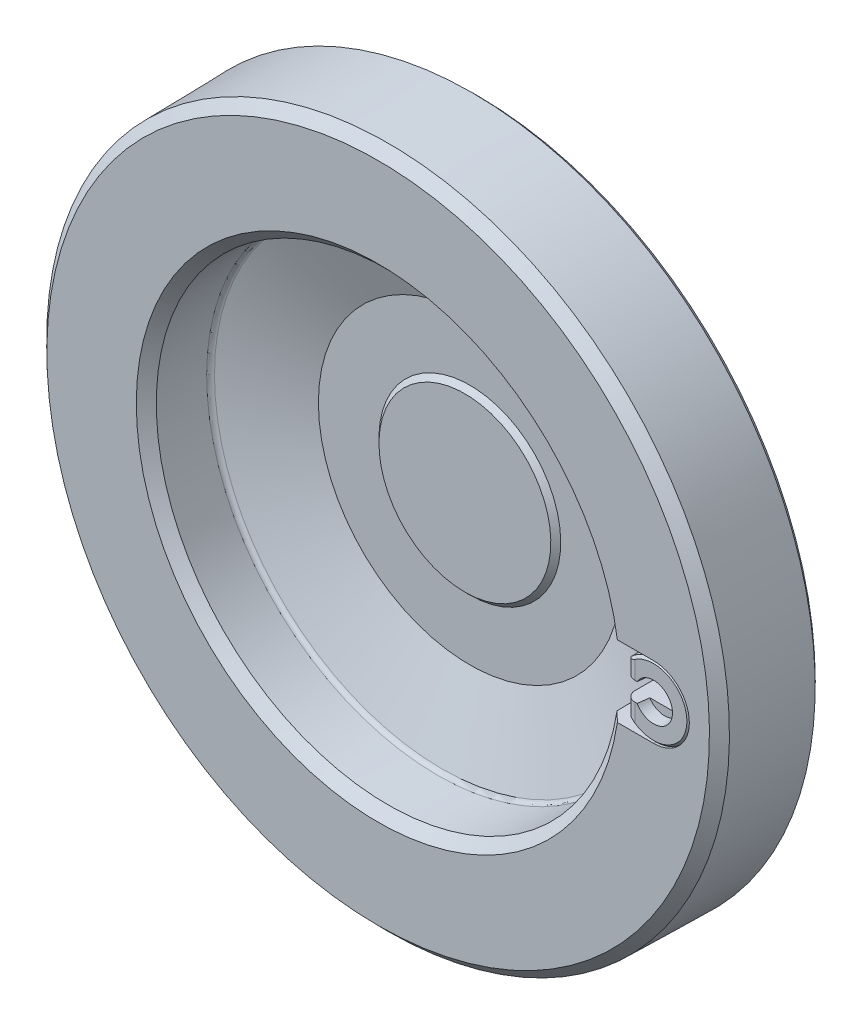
ISO-10303-21;
HEADER;
FILE_DESCRIPTION(('STEP AP214'),'2;1');
FILE_NAME('part.step','',(''),(''),'','','');
FILE_SCHEMA(('AUTOMOTIVE_DESIGN { 1 0 10303 214 1 1 1 1 }'));
ENDSEC;
DATA;
#1=APPLICATION_CONTEXT('core data for automotive mechanical design processes');
#2=APPLICATION_PROTOCOL_DEFINITION('international standard','automotive_design',2000,#1);
#3=PRODUCT_CONTEXT('',#1,'mechanical');
#4=PRODUCT('Part','Part','',(#3));
#5=PRODUCT_RELATED_PRODUCT_CATEGORY('part','',(#4));
#6=PRODUCT_DEFINITION_FORMATION('','',#4);
#7=PRODUCT_DEFINITION_CONTEXT('part definition',#1,'design');
#8=PRODUCT_DEFINITION('design','',#6,#7);
#9=PRODUCT_DEFINITION_SHAPE('','',#8);
#10=(LENGTH_UNIT() NAMED_UNIT(*) SI_UNIT(.MILLI.,.METRE.));
#11=(NAMED_UNIT(*) PLANE_ANGLE_UNIT() SI_UNIT($,.RADIAN.));
#12=(NAMED_UNIT(*) SI_UNIT($,.STERADIAN.) SOLID_ANGLE_UNIT());
#13=UNCERTAINTY_MEASURE_WITH_UNIT(LENGTH_MEASURE(1.E-05),#10,'distance_accuracy_value','');
#14=(GEOMETRIC_REPRESENTATION_CONTEXT(3) GLOBAL_UNCERTAINTY_ASSIGNED_CONTEXT((#13)) GLOBAL_UNIT_ASSIGNED_CONTEXT((#10,
#11,#12)) REPRESENTATION_CONTEXT('',''));
#15=CARTESIAN_POINT('',(0.,0.,0.));
#16=DIRECTION('',(0.,0.,1.));
#17=DIRECTION('',(1.,0.,0.));
#18=AXIS2_PLACEMENT_3D('',#15,#16,#17);
#19=CARTESIAN_POINT('',(100.,13.,76.));
#20=DIRECTION('',(0.,-1.,0.));
#21=DIRECTION('',(1.,0.,0.));
#22=AXIS2_PLACEMENT_3D('',#19,#20,#21);
#23=PLANE('',#22);
#24=CARTESIAN_POINT('',(100.,13.,62.75));
#25=DIRECTION('',(0.,-1.,0.));
#26=DIRECTION('',(1.,0.,0.));
#27=AXIS2_PLACEMENT_3D('',#24,#25,#26);
#28=CIRCLE('',#27,1.94999999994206);
#29=CARTESIAN_POINT('',(100.,13.,64.6999999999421));
#30=VERTEX_POINT('',#29);
#31=CARTESIAN_POINT('',(100.,13.,60.8000000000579));
#32=VERTEX_POINT('',#31);
#33=EDGE_CURVE('E256',#30,#32,#28,.T.);
#34=ORIENTED_EDGE('',*,*,#33,.F.);
#35=DIRECTION('',(0.,0.,1.));
#36=VECTOR('',#35,1.);
#37=CARTESIAN_POINT('',(100.,13.,76.));
#38=LINE('',#37,#36);
#39=CARTESIAN_POINT('',(100.,13.,65.35));
#40=VERTEX_POINT('',#39);
#41=EDGE_CURVE('E268',#30,#40,#38,.T.);
#42=ORIENTED_EDGE('',*,*,#41,.T.);
#43=CARTESIAN_POINT('',(100.,13.,75.1));
#44=VERTEX_POINT('',#43);
#45=EDGE_CURVE('E278',#40,#44,#38,.T.);
#46=ORIENTED_EDGE('',*,*,#45,.T.);
#47=CARTESIAN_POINT('',(100.,13.,76.));
#48=VERTEX_POINT('',#47);
#49=EDGE_CURVE('E281',#44,#48,#38,.T.);
#50=ORIENTED_EDGE('',*,*,#49,.T.);
#51=DIRECTION('',(-1.,0.,0.));
#52=VECTOR('',#51,1.);
#53=CARTESIAN_POINT('',(-87.8280930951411,13.,76.));
#54=LINE('',#53,#52);
#55=CARTESIAN_POINT('',(86.860658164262,13.,76.));
#56=VERTEX_POINT('',#55);
#57=EDGE_CURVE('E392',#48,#56,#54,.T.);
#58=ORIENTED_EDGE('',*,*,#57,.T.);
#59=CARTESIAN_POINT('',(86.860658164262,13.,76.));
#60=CARTESIAN_POINT('',(86.2432356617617,13.,75.3999375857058));
#61=CARTESIAN_POINT('',(85.6257384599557,13.,74.7999520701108));
#62=CARTESIAN_POINT('',(84.3905946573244,13.,73.6001348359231));
#63=CARTESIAN_POINT('',(83.7729480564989,13.,73.0003031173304));
#64=CARTESIAN_POINT('',(83.1552267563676,13.,72.400548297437));
#65=B_SPLINE_CURVE_WITH_KNOTS('',3,(#59,#60,#61,#62,#63,#64),.UNSPECIFIED.,.F.,.F.,(4,2,4),(0.,
2.58293800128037,5.16587600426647),.UNSPECIFIED.);
#66=CARTESIAN_POINT('',(83.1552267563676,13.,72.400548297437));
#67=VERTEX_POINT('',#66);
#68=EDGE_CURVE('E290',#56,#67,#65,.T.);
#69=ORIENTED_EDGE('',*,*,#68,.T.);
#70=CARTESIAN_POINT('',(83.1552267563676,13.,72.400548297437));
#71=CARTESIAN_POINT('',(83.1023127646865,13.,69.4054867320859));
#72=CARTESIAN_POINT('',(83.0493975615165,13.,66.4104251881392));
#73=CARTESIAN_POINT('',(82.943564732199,13.,60.4203021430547));
#74=CARTESIAN_POINT('',(82.8906471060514,13.,57.4252406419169));
#75=CARTESIAN_POINT('',(82.837728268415,13.,54.4301791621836));
#76=B_SPLINE_CURVE_WITH_KNOTS('',3,(#70,#71,#72,#73,#74,#75),.UNSPECIFIED.,.F.,.F.,(4,2,4),(0.,
8.98658684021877,17.9731736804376),.UNSPECIFIED.);
#77=CARTESIAN_POINT('',(82.837728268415,13.,54.4301791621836));
#78=VERTEX_POINT('',#77);
#79=EDGE_CURVE('E284',#67,#78,#76,.T.);
#80=ORIENTED_EDGE('',*,*,#79,.T.);
#81=CARTESIAN_POINT('',(82.837728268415,13.,54.4301791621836));
#82=CARTESIAN_POINT('',(82.8368300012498,13.,54.3794181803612));
#83=CARTESIAN_POINT('',(82.8337593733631,13.,54.3287254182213));
#84=CARTESIAN_POINT('',(82.8232997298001,13.,54.2277778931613));
#85=CARTESIAN_POINT('',(82.8159099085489,13.,54.1775232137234));
#86=CARTESIAN_POINT('',(82.7877537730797,13.,54.0302555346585));
#87=CARTESIAN_POINT('',(82.7609509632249,13.,53.9343097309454));
#88=CARTESIAN_POINT('',(82.7043886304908,13.,53.7820511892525));
#89=CARTESIAN_POINT('',(82.6792168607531,13.,53.7239711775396));
#90=CARTESIAN_POINT('',(82.6224683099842,13.,53.6099561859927));
#91=CARTESIAN_POINT('',(82.5908024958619,13.,53.5540655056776));
#92=CARTESIAN_POINT('',(82.5562106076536,13.,53.5));
#93=B_SPLINE_CURVE_WITH_KNOTS('',3,(#81,#82,#83,#84,#85,#86,#87,#88,#89,#90,#91,#92),
.UNSPECIFIED.,.F.,.F.,(4,2,2,2,2,4),(0.,0.152200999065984,0.30443039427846,0.601691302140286,
0.791276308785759,0.983658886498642),.UNSPECIFIED.);
#94=CARTESIAN_POINT('',(82.5562106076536,13.,53.5));
#95=VERTEX_POINT('',#94);
#96=EDGE_CURVE('E323',#78,#95,#93,.T.);
#97=ORIENTED_EDGE('',*,*,#96,.T.);
#98=DIRECTION('',(1.,0.,0.));
#99=VECTOR('',#98,1.);
#100=CARTESIAN_POINT('',(100.,13.,53.5));
#101=LINE('',#100,#99);
#102=CARTESIAN_POINT('',(100.,13.,53.5));
#103=VERTEX_POINT('',#102);
#104=EDGE_CURVE('E285',#95,#103,#101,.T.);
#105=ORIENTED_EDGE('',*,*,#104,.T.);
#106=CARTESIAN_POINT('',(100.,13.,60.15));
#107=VERTEX_POINT('',#106);
#108=EDGE_CURVE('E280',#103,#107,#38,.T.);
#109=ORIENTED_EDGE('',*,*,#108,.T.);
#110=EDGE_CURVE('E270',#107,#32,#38,.T.);
#111=ORIENTED_EDGE('',*,*,#110,.T.);
#112=EDGE_LOOP('',(#34,#42,#46,#50,#58,#69,#80,#97,#105,#109,#111));
#113=FACE_BOUND('',#112,.T.);
#114=ADVANCED_FACE('F15',(#113),#23,.T.);
#115=CARTESIAN_POINT('',(100.,0.,76.));
#116=DIRECTION('',(0.,0.,1.));
#117=DIRECTION('',(0.,1.,0.));
#118=AXIS2_PLACEMENT_3D('',#115,#116,#117);
#119=CYLINDRICAL_SURFACE('',#118,13.);
#120=CARTESIAN_POINT('',(100.,13.,65.35));
#121=CARTESIAN_POINT('',(100.072361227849,13.000005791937,65.3500078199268));
#122=CARTESIAN_POINT('',(100.144718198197,12.9993959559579,65.3469792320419));
#123=CARTESIAN_POINT('',(100.28890073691,12.996987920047,65.3349098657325));
#124=CARTESIAN_POINT('',(100.36072636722,12.995189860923,65.325869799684));
#125=CARTESIAN_POINT('',(100.503234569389,12.990451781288,65.3018559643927));
#126=CARTESIAN_POINT('',(100.573918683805,12.9875134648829,65.2868910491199));
#127=CARTESIAN_POINT('',(100.71373187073,12.9805814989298,65.2511597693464));
#128=CARTESIAN_POINT('',(100.782860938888,12.9765878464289,65.2303933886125));
#129=CARTESIAN_POINT('',(100.987207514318,12.9631775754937,65.159596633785));
#130=CARTESIAN_POINT('',(101.119493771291,12.9523277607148,65.1010500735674));
#131=CARTESIAN_POINT('',(101.372304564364,12.9279918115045,64.9630425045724));
#132=CARTESIAN_POINT('',(101.492828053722,12.9145054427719,64.8835796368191));
#133=CARTESIAN_POINT('',(101.720392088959,12.8861770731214,64.704845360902));
#134=CARTESIAN_POINT('',(101.827253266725,12.8713207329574,64.6053474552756));
#135=CARTESIAN_POINT('',(102.022889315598,12.8420299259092,64.3898495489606));
#136=CARTESIAN_POINT('',(102.111661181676,12.8275955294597,64.2738468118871));
#137=CARTESIAN_POINT('',(102.269364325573,12.8006431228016,64.0273345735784));
#138=CARTESIAN_POINT('',(102.338108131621,12.7881437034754,63.8967029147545));
#139=CARTESIAN_POINT('',(102.452597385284,12.7666824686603,63.6254594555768));
#140=CARTESIAN_POINT('',(102.498346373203,12.7577201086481,63.4848491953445));
#141=CARTESIAN_POINT('',(102.564965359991,12.74449301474,63.1995823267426));
#142=CARTESIAN_POINT('',(102.586153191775,12.7401683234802,63.0550027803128));
#143=CARTESIAN_POINT('',(102.604035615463,12.7365257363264,62.7642778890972));
#144=CARTESIAN_POINT('',(102.600732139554,12.7372074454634,62.6181326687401));
#145=CARTESIAN_POINT('',(102.569981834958,12.7434463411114,62.3307578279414));
#146=CARTESIAN_POINT('',(102.542900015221,12.7489298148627,62.1894873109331));
#147=CARTESIAN_POINT('',(102.465938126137,12.7640382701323,61.9135372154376));
#148=CARTESIAN_POINT('',(102.416057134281,12.7736634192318,61.7788579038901));
#149=CARTESIAN_POINT('',(102.294563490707,12.7960462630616,61.5188582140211));
#150=CARTESIAN_POINT('',(102.222805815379,12.8088247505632,61.3936074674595));
#151=CARTESIAN_POINT('',(102.059700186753,12.83606055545,61.1567921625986));
#152=CARTESIAN_POINT('',(101.968350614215,12.8505180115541,61.0452287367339));
#153=CARTESIAN_POINT('',(101.766713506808,12.8798006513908,60.8368571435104));
#154=CARTESIAN_POINT('',(101.656116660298,12.8946277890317,60.7403483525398));
#155=CARTESIAN_POINT('',(101.420111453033,12.9227466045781,60.567179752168));
#156=CARTESIAN_POINT('',(101.294699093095,12.9360378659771,60.4905253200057));
#157=CARTESIAN_POINT('',(101.032272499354,12.9596220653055,60.3591840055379));
#158=CARTESIAN_POINT('',(100.895234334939,12.9699086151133,60.3045438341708));
#159=CARTESIAN_POINT('',(100.613760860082,12.9862647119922,60.2192192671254));
#160=CARTESIAN_POINT('',(100.469336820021,12.9923404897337,60.1884994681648));
#161=CARTESIAN_POINT('',(100.269799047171,12.9973123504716,60.1634670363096));
#162=CARTESIAN_POINT('',(100.215920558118,12.9983192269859,60.1584151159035));
#163=CARTESIAN_POINT('',(100.10803613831,12.9996624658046,60.1516858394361));
#164=CARTESIAN_POINT('',(100.054030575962,12.9999999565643,60.1500028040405));
#165=CARTESIAN_POINT('',(100.,13.,60.15));
#166=B_SPLINE_CURVE_WITH_KNOTS('',3,(#120,#121,#122,#123,#124,#125,#126,#127,#128,#129,#130,
#131,#132,#133,#134,#135,#136,#137,#138,#139,#140,#141,#142,#143,#144,#145,#146,#147,#148,#149,
#150,#151,#152,#153,#154,#155,#156,#157,#158,#159,#160,#161,#162,#163,#164,#165),.UNSPECIFIED.,
.F.,.F.,(4,2,2,2,2,2,2,2,2,2,2,2,2,2,2,2,2,2,2,2,2,2,4),(0.,0.217010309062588,0.433994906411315,
0.650656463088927,0.867318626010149,1.30031410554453,1.73334808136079,2.17158421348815,
2.60989308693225,3.05218181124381,3.49440241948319,3.93083424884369,4.36723164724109,
4.79704500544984,5.22687575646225,5.65962026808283,6.09240055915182,6.53291633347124,
6.97355129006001,7.41511634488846,7.85602661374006,8.01831502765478,8.18032962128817),.UNSPECIFIED.);
#167=EDGE_CURVE('E276',#40,#107,#166,.T.);
#168=ORIENTED_EDGE('',*,*,#167,.F.);
#169=ORIENTED_EDGE('',*,*,#41,.F.);
#170=CARTESIAN_POINT('',(99.7398,12.9973957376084,64.6851897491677));
#171=CARTESIAN_POINT('',(99.8028729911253,12.9986608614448,64.6923943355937));
#172=CARTESIAN_POINT('',(99.8662239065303,12.9994667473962,64.6969740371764));
#173=CARTESIAN_POINT('',(99.993091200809,13.0001526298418,64.700868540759));
#174=CARTESIAN_POINT('',(100.056607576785,13.0000326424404,64.700183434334));
#175=CARTESIAN_POINT('',(100.24672928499,12.9982736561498,64.6902133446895));
#176=CARTESIAN_POINT('',(100.373001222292,12.9952375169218,64.673024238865));
#177=CARTESIAN_POINT('',(100.620724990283,12.9857653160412,64.617892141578));
#178=CARTESIAN_POINT('',(100.742177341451,12.9793296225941,64.5799513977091));
#179=CARTESIAN_POINT('',(100.976739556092,12.9637874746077,64.4840697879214));
#180=CARTESIAN_POINT('',(101.089851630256,12.9546817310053,64.4261342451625));
#181=CARTESIAN_POINT('',(101.302263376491,12.935041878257,64.2925777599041));
#182=CARTESIAN_POINT('',(101.401767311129,12.9245350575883,64.2172784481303));
#183=CARTESIAN_POINT('',(101.585681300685,12.9032629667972,64.0500270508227));
#184=CARTESIAN_POINT('',(101.670093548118,12.8924977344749,63.9580773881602));
#185=CARTESIAN_POINT('',(101.815695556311,12.8727752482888,63.7657246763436));
#186=CARTESIAN_POINT('',(101.877969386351,12.8637484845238,63.6661518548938));
#187=CARTESIAN_POINT('',(101.982973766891,12.8479826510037,63.4570283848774));
#188=CARTESIAN_POINT('',(102.025721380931,12.8412415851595,63.3474865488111));
#189=CARTESIAN_POINT('',(102.086290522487,12.8315332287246,63.1327745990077));
#190=CARTESIAN_POINT('',(102.106091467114,12.8282686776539,63.0281750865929));
#191=CARTESIAN_POINT('',(102.12671586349,12.8248664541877,62.8170832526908));
#192=CARTESIAN_POINT('',(102.12754768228,12.8247274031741,62.7105917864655));
#193=CARTESIAN_POINT('',(102.110785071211,12.8274954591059,62.5062234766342));
#194=CARTESIAN_POINT('',(102.094401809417,12.8302023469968,62.4082415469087));
#195=CARTESIAN_POINT('',(102.045833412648,12.838035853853,62.2163955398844));
#196=CARTESIAN_POINT('',(102.013647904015,12.843162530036,62.122531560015));
#197=CARTESIAN_POINT('',(101.934231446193,12.8553636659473,61.9398895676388));
#198=CARTESIAN_POINT('',(101.886782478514,12.8624661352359,61.8512087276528));
#199=CARTESIAN_POINT('',(101.77875423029,12.8778493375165,61.6823691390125));
#200=CARTESIAN_POINT('',(101.718170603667,12.8861304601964,61.6022132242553));
#201=CARTESIAN_POINT('',(101.580595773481,12.9037544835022,61.4460025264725));
#202=CARTESIAN_POINT('',(101.502693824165,12.9131298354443,61.3707542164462));
#203=CARTESIAN_POINT('',(101.336207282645,12.9314177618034,61.2331562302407));
#204=CARTESIAN_POINT('',(101.247620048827,12.9403302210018,61.1708097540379));
#205=CARTESIAN_POINT('',(101.053933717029,12.9576023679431,61.0551284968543));
#206=CARTESIAN_POINT('',(100.948068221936,12.9658457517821,61.0030567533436));
#207=CARTESIAN_POINT('',(100.72930752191,12.9799903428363,60.9161859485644));
#208=CARTESIAN_POINT('',(100.61640824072,12.9858901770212,60.8813970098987));
#209=CARTESIAN_POINT('',(100.376868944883,12.9951313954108,60.8275764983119));
#210=CARTESIAN_POINT('',(100.249864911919,12.9982207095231,60.8100868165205));
#211=CARTESIAN_POINT('',(100.058603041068,13.000025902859,60.7998549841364));
#212=CARTESIAN_POINT('',(99.9946849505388,13.0001554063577,60.7991158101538));
#213=CARTESIAN_POINT('',(99.8670181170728,12.9994767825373,60.8029689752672));
#214=CARTESIAN_POINT('',(99.8032693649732,12.9986687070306,60.8075610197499));
#215=CARTESIAN_POINT('',(99.7398,12.9973957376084,60.8148102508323));
#216=B_SPLINE_CURVE_WITH_KNOTS('',3,(#170,#171,#172,#173,#174,#175,#176,#177,#178,#179,#180,
#181,#182,#183,#184,#185,#186,#187,#188,#189,#190,#191,#192,#193,#194,#195,#196,#197,#198,#199,
#200,#201,#202,#203,#204,#205,#206,#207,#208,#209,#210,#211,#212,#213,#214,#215),.UNSPECIFIED.,
.F.,.F.,(4,2,2,2,2,2,2,2,2,2,2,2,2,2,2,2,2,2,2,2,2,2,4),(0.,0.190369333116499,0.380735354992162,
0.761187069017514,1.1415975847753,1.52190690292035,1.89566906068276,2.26937687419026,
2.62081582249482,2.9719470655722,3.28977856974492,3.60746987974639,3.90421682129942,
4.20097078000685,4.50216716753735,4.80346336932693,5.12824100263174,5.45309909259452,
5.80633616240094,6.15977988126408,6.54246695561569,6.73403804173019,6.92559854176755),.UNSPECIFIED.);
#217=EDGE_CURVE('E20',#30,#32,#216,.T.);
#218=ORIENTED_EDGE('',*,*,#217,.T.);
#219=ORIENTED_EDGE('',*,*,#110,.F.);
#220=EDGE_LOOP('',(#168,#169,#218,#219));
#221=FACE_BOUND('',#220,.T.);
#222=ADVANCED_FACE('F274',(#221),#119,.F.);
#223=CARTESIAN_POINT('',(0.,-13.,76.));
#224=DIRECTION('',(0.,1.,0.));
#225=DIRECTION('',(-1.,0.,0.));
#226=AXIS2_PLACEMENT_3D('',#223,#224,#225);
#227=PLANE('',#226);
#228=CARTESIAN_POINT('',(100.,-13.,62.75));
#229=DIRECTION('',(0.,1.,0.));
#230=DIRECTION('',(-1.,0.,0.));
#231=AXIS2_PLACEMENT_3D('',#228,#229,#230);
#232=CIRCLE('',#231,1.95000000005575);
#233=CARTESIAN_POINT('',(100.,-13.,60.7999999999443));
#234=VERTEX_POINT('',#233);
#235=CARTESIAN_POINT('',(100.,-13.,64.7000000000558));
#236=VERTEX_POINT('',#235);
#237=EDGE_CURVE('E271',#234,#236,#232,.T.);
#238=ORIENTED_EDGE('',*,*,#237,.F.);
#239=DIRECTION('',(0.,0.,1.));
#240=VECTOR('',#239,1.);
#241=CARTESIAN_POINT('',(100.,-13.,76.));
#242=LINE('',#241,#240);
#243=CARTESIAN_POINT('',(100.,-13.,60.15));
#244=VERTEX_POINT('',#243);
#245=EDGE_CURVE('E412',#234,#244,#242,.F.);
#246=ORIENTED_EDGE('',*,*,#245,.T.);
#247=CARTESIAN_POINT('',(100.,-13.,53.5));
#248=VERTEX_POINT('',#247);
#249=EDGE_CURVE('E405',#244,#248,#242,.F.);
#250=ORIENTED_EDGE('',*,*,#249,.T.);
#251=DIRECTION('',(-1.,0.,0.));
#252=VECTOR('',#251,1.);
#253=CARTESIAN_POINT('',(0.,-13.,53.5));
#254=LINE('',#253,#252);
#255=CARTESIAN_POINT('',(82.5562106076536,-13.,53.5));
#256=VERTEX_POINT('',#255);
#257=EDGE_CURVE('E398',#248,#256,#254,.T.);
#258=ORIENTED_EDGE('',*,*,#257,.T.);
#259=CARTESIAN_POINT('',(82.5562106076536,-13.,53.5));
#260=CARTESIAN_POINT('',(82.5835692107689,-13.,53.5427682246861));
#261=CARTESIAN_POINT('',(82.6091007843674,-13.,53.5866711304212));
#262=CARTESIAN_POINT('',(82.6563561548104,-13.,53.6764944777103));
#263=CARTESIAN_POINT('',(82.6780789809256,-13.,53.7224154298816));
#264=CARTESIAN_POINT('',(82.7363486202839,-13.,53.8605757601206));
#265=CARTESIAN_POINT('',(82.7673044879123,-13.,53.9552673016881));
#266=CARTESIAN_POINT('',(82.8047241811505,-13.,54.113321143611));
#267=CARTESIAN_POINT('',(82.8159982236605,-13.,54.1756036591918));
#268=CARTESIAN_POINT('',(82.8319850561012,-13.,54.3019408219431));
#269=CARTESIAN_POINT('',(82.8365984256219,-13.,54.3660080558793));
#270=CARTESIAN_POINT('',(82.837728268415,-13.,54.4301791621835));
#271=B_SPLINE_CURVE_WITH_KNOTS('',3,(#259,#260,#261,#262,#263,#264,#265,#266,#267,#268,#269,
#270),.UNSPECIFIED.,.F.,.F.,(4,2,2,2,2,4),(0.,0.152207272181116,0.304453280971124,
0.601728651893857,0.791292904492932,0.983658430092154),.UNSPECIFIED.);
#272=CARTESIAN_POINT('',(82.837728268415,-13.,54.4301791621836));
#273=VERTEX_POINT('',#272);
#274=EDGE_CURVE('E315',#256,#273,#271,.T.);
#275=ORIENTED_EDGE('',*,*,#274,.T.);
#276=CARTESIAN_POINT('',(82.837728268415,-13.,54.4301791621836));
#277=CARTESIAN_POINT('',(82.8906471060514,-13.,57.4252406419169));
#278=CARTESIAN_POINT('',(82.943564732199,-13.,60.4203021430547));
#279=CARTESIAN_POINT('',(83.0493975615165,-13.,66.4104251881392));
#280=CARTESIAN_POINT('',(83.1023127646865,-13.,69.4054867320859));
#281=CARTESIAN_POINT('',(83.1552267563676,-13.,72.400548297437));
#282=B_SPLINE_CURVE_WITH_KNOTS('',3,(#276,#277,#278,#279,#280,#281),.UNSPECIFIED.,.F.,.F.,(4,2,
4),(0.,8.98658684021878,17.9731736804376),.UNSPECIFIED.);
#283=CARTESIAN_POINT('',(83.1552267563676,-13.,72.400548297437));
#284=VERTEX_POINT('',#283);
#285=EDGE_CURVE('E357',#273,#284,#282,.T.);
#286=ORIENTED_EDGE('',*,*,#285,.T.);
#287=CARTESIAN_POINT('',(83.1552267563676,-13.,72.400548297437));
#288=CARTESIAN_POINT('',(83.7729480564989,-13.,73.0003031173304));
#289=CARTESIAN_POINT('',(84.3905946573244,-13.,73.6001348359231));
#290=CARTESIAN_POINT('',(85.6257384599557,-13.,74.7999520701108));
#291=CARTESIAN_POINT('',(86.2432356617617,-13.,75.3999375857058));
#292=CARTESIAN_POINT('',(86.860658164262,-13.,76.));
#293=B_SPLINE_CURVE_WITH_KNOTS('',3,(#287,#288,#289,#290,#291,#292),.UNSPECIFIED.,.F.,.F.,(4,2,
4),(0.,2.5829380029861,5.16587600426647),.UNSPECIFIED.);
#294=CARTESIAN_POINT('',(86.860658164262,-13.,76.));
#295=VERTEX_POINT('',#294);
#296=EDGE_CURVE('E364',#284,#295,#293,.T.);
#297=ORIENTED_EDGE('',*,*,#296,.T.);
#298=DIRECTION('',(-1.,0.,0.));
#299=VECTOR('',#298,1.);
#300=CARTESIAN_POINT('',(-87.8280930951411,-13.,76.));
#301=LINE('',#300,#299);
#302=CARTESIAN_POINT('',(100.,-13.,76.));
#303=VERTEX_POINT('',#302);
#304=EDGE_CURVE('E422',#295,#303,#301,.F.);
#305=ORIENTED_EDGE('',*,*,#304,.T.);
#306=CARTESIAN_POINT('',(100.,-13.,75.1));
#307=VERTEX_POINT('',#306);
#308=EDGE_CURVE('E402',#303,#307,#242,.F.);
#309=ORIENTED_EDGE('',*,*,#308,.T.);
#310=CARTESIAN_POINT('',(100.,-13.,65.35));
#311=VERTEX_POINT('',#310);
#312=EDGE_CURVE('E404',#307,#311,#242,.F.);
#313=ORIENTED_EDGE('',*,*,#312,.T.);
#314=EDGE_CURVE('E410',#311,#236,#242,.F.);
#315=ORIENTED_EDGE('',*,*,#314,.T.);
#316=EDGE_LOOP('',(#238,#246,#250,#258,#275,#286,#297,#305,#309,#313,#315));
#317=FACE_BOUND('',#316,.T.);
#318=ADVANCED_FACE('F372',(#317),#227,.T.);
#319=CARTESIAN_POINT('',(100.,-13.,60.15));
#320=CARTESIAN_POINT('',(100.072361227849,-13.000005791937,60.1499921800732));
#321=CARTESIAN_POINT('',(100.144718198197,-12.9993959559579,60.1530207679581));
#322=CARTESIAN_POINT('',(100.28890073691,-12.996987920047,60.1650901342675));
#323=CARTESIAN_POINT('',(100.36072636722,-12.995189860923,60.174130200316));
#324=CARTESIAN_POINT('',(100.503234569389,-12.990451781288,60.1981440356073));
#325=CARTESIAN_POINT('',(100.573918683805,-12.9875134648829,60.21310895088));
#326=CARTESIAN_POINT('',(100.71373187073,-12.9805814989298,60.2488402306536));
#327=CARTESIAN_POINT('',(100.782860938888,-12.9765878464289,60.2696066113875));
#328=CARTESIAN_POINT('',(100.987207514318,-12.9631775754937,60.340403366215));
#329=CARTESIAN_POINT('',(101.119493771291,-12.9523277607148,60.3989499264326));
#330=CARTESIAN_POINT('',(101.372304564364,-12.9279918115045,60.5369574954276));
#331=CARTESIAN_POINT('',(101.492828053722,-12.9145054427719,60.6164203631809));
#332=CARTESIAN_POINT('',(101.720392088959,-12.8861770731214,60.795154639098));
#333=CARTESIAN_POINT('',(101.827253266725,-12.8713207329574,60.8946525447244));
#334=CARTESIAN_POINT('',(102.022889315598,-12.8420299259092,61.1101504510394));
#335=CARTESIAN_POINT('',(102.111661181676,-12.8275955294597,61.2261531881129));
#336=CARTESIAN_POINT('',(102.269364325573,-12.8006431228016,61.4726654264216));
#337=CARTESIAN_POINT('',(102.338108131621,-12.7881437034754,61.6032970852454));
#338=CARTESIAN_POINT('',(102.452597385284,-12.7666824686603,61.8745405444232));
#339=CARTESIAN_POINT('',(102.498346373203,-12.7577201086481,62.0151508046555));
#340=CARTESIAN_POINT('',(102.564965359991,-12.74449301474,62.3004176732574));
#341=CARTESIAN_POINT('',(102.586153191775,-12.7401683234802,62.4449972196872));
#342=CARTESIAN_POINT('',(102.604035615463,-12.7365257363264,62.7357221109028));
#343=CARTESIAN_POINT('',(102.600732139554,-12.7372074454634,62.8818673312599));
#344=CARTESIAN_POINT('',(102.569981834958,-12.7434463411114,63.1692421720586));
#345=CARTESIAN_POINT('',(102.542900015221,-12.7489298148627,63.3105126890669));
#346=CARTESIAN_POINT('',(102.465938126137,-12.7640382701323,63.5864627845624));
#347=CARTESIAN_POINT('',(102.416057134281,-12.7736634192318,63.7211420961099));
#348=CARTESIAN_POINT('',(102.294563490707,-12.7960462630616,63.9811417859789));
#349=CARTESIAN_POINT('',(102.222805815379,-12.8088247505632,64.1063925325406));
#350=CARTESIAN_POINT('',(102.059700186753,-12.83606055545,64.3432078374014));
#351=CARTESIAN_POINT('',(101.968350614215,-12.8505180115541,64.4547712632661));
#352=CARTESIAN_POINT('',(101.766713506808,-12.8798006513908,64.6631428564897));
#353=CARTESIAN_POINT('',(101.656116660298,-12.8946277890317,64.7596516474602));
#354=CARTESIAN_POINT('',(101.420111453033,-12.9227466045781,64.932820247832));
#355=CARTESIAN_POINT('',(101.294699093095,-12.9360378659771,65.0094746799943));
#356=CARTESIAN_POINT('',(101.032272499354,-12.9596220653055,65.1408159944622));
#357=CARTESIAN_POINT('',(100.895234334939,-12.9699086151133,65.1954561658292));
#358=CARTESIAN_POINT('',(100.613760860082,-12.9862647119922,65.2807807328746));
#359=CARTESIAN_POINT('',(100.469336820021,-12.9923404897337,65.3115005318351));
#360=CARTESIAN_POINT('',(100.269799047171,-12.9973123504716,65.3365329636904));
#361=CARTESIAN_POINT('',(100.215920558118,-12.9983192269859,65.3415848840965));
#362=CARTESIAN_POINT('',(100.10803613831,-12.9996624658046,65.3483141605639));
#363=CARTESIAN_POINT('',(100.054030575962,-12.9999999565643,65.3499971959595));
#364=CARTESIAN_POINT('',(100.,-13.,65.35));
#365=B_SPLINE_CURVE_WITH_KNOTS('',3,(#319,#320,#321,#322,#323,#324,#325,#326,#327,#328,#329,
#330,#331,#332,#333,#334,#335,#336,#337,#338,#339,#340,#341,#342,#343,#344,#345,#346,#347,#348,
#349,#350,#351,#352,#353,#354,#355,#356,#357,#358,#359,#360,#361,#362,#363,#364),.UNSPECIFIED.,
.F.,.F.,(4,2,2,2,2,2,2,2,2,2,2,2,2,2,2,2,2,2,2,2,2,2,4),(0.,0.217010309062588,0.433994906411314,
0.650656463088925,0.86731862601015,1.30031410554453,1.73334808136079,2.17158421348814,
2.60989308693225,3.0521818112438,3.49440241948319,3.93083424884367,4.36723164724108,
4.79704500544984,5.22687575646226,5.65962026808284,6.09240055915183,6.53291633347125,
6.97355129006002,7.41511634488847,7.85602661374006,8.01831502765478,8.18032962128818),.UNSPECIFIED.);
#366=EDGE_CURVE('E263',#244,#311,#365,.T.);
#367=ORIENTED_EDGE('',*,*,#366,.F.);
#368=ORIENTED_EDGE('',*,*,#245,.F.);
#369=CARTESIAN_POINT('',(99.7398,-12.9973957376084,60.8148102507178));
#370=CARTESIAN_POINT('',(99.8028729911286,-12.9986608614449,60.8076056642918));
#371=CARTESIAN_POINT('',(99.866223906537,-12.9994667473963,60.8030259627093));
#372=CARTESIAN_POINT('',(99.9930912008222,-13.0001526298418,60.7991314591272));
#373=CARTESIAN_POINT('',(100.056607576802,-13.0000326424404,60.7998165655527));
#374=CARTESIAN_POINT('',(100.246729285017,-12.9982736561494,60.8097866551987));
#375=CARTESIAN_POINT('',(100.373001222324,-12.9952375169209,60.8269757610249));
#376=CARTESIAN_POINT('',(100.620724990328,-12.9857653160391,60.8821078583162));
#377=CARTESIAN_POINT('',(100.742177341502,-12.9793296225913,60.9200486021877));
#378=CARTESIAN_POINT('',(100.976739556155,-12.9637874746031,61.0159302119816));
#379=CARTESIAN_POINT('',(101.089851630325,-12.9546817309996,61.0738657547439));
#380=CARTESIAN_POINT('',(101.30226337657,-12.9350418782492,61.2074222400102));
#381=CARTESIAN_POINT('',(101.401767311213,-12.9245350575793,61.2827215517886));
#382=CARTESIAN_POINT('',(101.585681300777,-12.9032629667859,61.4499729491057));
#383=CARTESIAN_POINT('',(101.670093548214,-12.8924977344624,61.5419226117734));
#384=CARTESIAN_POINT('',(101.815695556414,-12.8727752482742,61.734275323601));
#385=CARTESIAN_POINT('',(101.877969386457,-12.8637484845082,61.8338481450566));
#386=CARTESIAN_POINT('',(101.982973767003,-12.8479826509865,62.042971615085));
#387=CARTESIAN_POINT('',(102.025721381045,-12.8412415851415,62.1525134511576));
#388=CARTESIAN_POINT('',(102.086290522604,-12.8315332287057,62.3672254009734));
#389=CARTESIAN_POINT('',(102.106091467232,-12.8282686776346,62.4718249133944));
#390=CARTESIAN_POINT('',(102.126715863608,-12.8248664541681,62.6829167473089));
#391=CARTESIAN_POINT('',(102.127547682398,-12.8247274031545,62.7894082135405));
#392=CARTESIAN_POINT('',(102.110785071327,-12.8274954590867,62.9937765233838));
#393=CARTESIAN_POINT('',(102.094401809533,-12.830202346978,63.0917584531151));
#394=CARTESIAN_POINT('',(102.04583341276,-12.8380358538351,63.2836044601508));
#395=CARTESIAN_POINT('',(102.013647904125,-12.8431625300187,63.3774684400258));
#396=CARTESIAN_POINT('',(101.934231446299,-12.8553636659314,63.5601104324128));
#397=CARTESIAN_POINT('',(101.886782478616,-12.8624661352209,63.648791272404));
#398=CARTESIAN_POINT('',(101.778754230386,-12.8778493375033,63.8176308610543));
#399=CARTESIAN_POINT('',(101.718170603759,-12.8861304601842,63.8977867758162));
#400=CARTESIAN_POINT('',(101.580595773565,-12.903754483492,64.0539974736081));
#401=CARTESIAN_POINT('',(101.502693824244,-12.9131298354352,64.1292457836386));
#402=CARTESIAN_POINT('',(101.336207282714,-12.9314177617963,64.266843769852));
#403=CARTESIAN_POINT('',(101.24762004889,-12.9403302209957,64.3291902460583));
#404=CARTESIAN_POINT('',(101.053933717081,-12.9576023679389,64.4448715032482));
#405=CARTESIAN_POINT('',(100.948068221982,-12.9658457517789,64.4969432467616));
#406=CARTESIAN_POINT('',(100.729307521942,-12.9799903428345,64.5838140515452));
#407=CARTESIAN_POINT('',(100.616408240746,-12.98589017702,64.6186029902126));
#408=CARTESIAN_POINT('',(100.3768689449,-12.9951313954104,64.6724235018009));
#409=CARTESIAN_POINT('',(100.249864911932,-12.9982207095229,64.6899131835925));
#410=CARTESIAN_POINT('',(100.058603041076,-13.000025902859,64.7001450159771));
#411=CARTESIAN_POINT('',(99.9946849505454,-13.0001554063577,64.7008841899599));
#412=CARTESIAN_POINT('',(99.8670181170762,-12.9994767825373,64.6970310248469));
#413=CARTESIAN_POINT('',(99.8032693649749,-12.9986687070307,64.6924389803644));
#414=CARTESIAN_POINT('',(99.7398,-12.9973957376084,64.6851897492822));
#415=B_SPLINE_CURVE_WITH_KNOTS('',3,(#369,#370,#371,#372,#373,#374,#375,#376,#377,#378,#379,
#380,#381,#382,#383,#384,#385,#386,#387,#388,#389,#390,#391,#392,#393,#394,#395,#396,#397,#398,
#399,#400,#401,#402,#403,#404,#405,#406,#407,#408,#409,#410,#411,#412,#413,#414),.UNSPECIFIED.,
.F.,.F.,(4,2,2,2,2,2,2,2,2,2,2,2,2,2,2,2,2,2,2,2,2,2,4),(0.,0.190369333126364,0.380735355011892,
0.761187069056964,1.14159758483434,1.52190690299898,1.89566906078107,2.26937687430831,
2.62081582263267,2.9719470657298,3.28977856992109,3.60746987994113,3.90421682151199,
4.20097078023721,4.50216716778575,4.80346336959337,5.12824100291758,5.45309909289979,
5.80633616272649,6.15977988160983,6.54246695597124,6.73403804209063,6.92559854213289),.UNSPECIFIED.);
#416=EDGE_CURVE('E264',#234,#236,#415,.T.);
#417=ORIENTED_EDGE('',*,*,#416,.T.);
#418=ORIENTED_EDGE('',*,*,#314,.F.);
#419=EDGE_LOOP('',(#367,#368,#417,#418));
#420=FACE_BOUND('',#419,.T.);
#421=ADVANCED_FACE('F376',(#420),#119,.F.);
#422=CARTESIAN_POINT('',(100.,0.,53.5));
#423=DIRECTION('',(0.,0.,1.));
#424=DIRECTION('',(0.,1.,0.));
#425=AXIS2_PLACEMENT_3D('',#422,#423,#424);
#426=PLANE('',#425);
#427=CARTESIAN_POINT('',(100.,0.,53.5));
#428=DIRECTION('',(0.,0.,-1.));
#429=DIRECTION('',(-1.,0.,0.));
#430=AXIS2_PLACEMENT_3D('',#427,#428,#429);
#431=CIRCLE('',#430,13.);
#432=CARTESIAN_POINT('',(89.6,-7.8,53.5));
#433=VERTEX_POINT('',#432);
#434=EDGE_CURVE('E32',#433,#248,#431,.F.);
#435=ORIENTED_EDGE('',*,*,#434,.F.);
#436=DIRECTION('',(0.,-1.,0.));
#437=VECTOR('',#436,1.);
#438=CARTESIAN_POINT('',(89.6,0.,53.5));
#439=LINE('',#438,#437);
#440=CARTESIAN_POINT('',(89.6,7.8,53.5));
#441=VERTEX_POINT('',#440);
#442=EDGE_CURVE('E723',#441,#433,#439,.T.);
#443=ORIENTED_EDGE('',*,*,#442,.F.);
#444=CARTESIAN_POINT('',(100.,0.,53.5));
#445=DIRECTION('',(0.,0.,1.));
#446=DIRECTION('',(0.,1.,0.));
#447=AXIS2_PLACEMENT_3D('',#444,#445,#446);
#448=CIRCLE('',#447,13.);
#449=EDGE_CURVE('E500',#103,#441,#448,.T.);
#450=ORIENTED_EDGE('',*,*,#449,.F.);
#451=ORIENTED_EDGE('',*,*,#104,.F.);
#452=CARTESIAN_POINT('',(0.,0.,53.5));
#453=DIRECTION('',(0.,0.,-1.));
#454=DIRECTION('',(0.,-1.,0.));
#455=AXIS2_PLACEMENT_3D('',#452,#453,#454);
#456=CIRCLE('',#455,83.5734880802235);
#457=EDGE_CURVE('E294',#95,#256,#456,.T.);
#458=ORIENTED_EDGE('',*,*,#457,.T.);
#459=ORIENTED_EDGE('',*,*,#257,.F.);
#460=EDGE_LOOP('',(#435,#443,#450,#451,#458,#459));
#461=FACE_BOUND('',#460,.T.);
#462=ADVANCED_FACE('F307',(#461),#426,.T.);
#463=CARTESIAN_POINT('',(0.,0.,54.4615934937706));
#464=DIRECTION('',(0.,0.,-1.));
#465=DIRECTION('',(0.,-1.,0.));
#466=AXIS2_PLACEMENT_3D('',#463,#464,#465);
#467=TOROIDAL_SURFACE('',#466,82.0518646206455,1.8);
#468=CARTESIAN_POINT('',(0.,0.,52.770146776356));
#469=DIRECTION('',(0.,0.,-1.));
#470=DIRECTION('',(0.,-1.,0.));
#471=AXIS2_PLACEMENT_3D('',#468,#469,#470);
#472=CIRCLE('',#471,82.6675008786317);
#473=CARTESIAN_POINT('',(0.,-82.6675008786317,52.770146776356));
#474=VERTEX_POINT('',#473);
#475=EDGE_CURVE('E298',#474,#474,#472,.F.);
#476=ORIENTED_EDGE('',*,*,#475,.F.);
#477=EDGE_LOOP('',(#476));
#478=FACE_BOUND('',#477,.T.);
#479=ORIENTED_EDGE('',*,*,#274,.F.);
#480=ORIENTED_EDGE('',*,*,#457,.F.);
#481=ORIENTED_EDGE('',*,*,#96,.F.);
#482=CARTESIAN_POINT('',(0.,0.,54.4301791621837));
#483=DIRECTION('',(0.,0.,1.));
#484=DIRECTION('',(0.,1.,0.));
#485=AXIS2_PLACEMENT_3D('',#482,#483,#484);
#486=CIRCLE('',#485,83.851590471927);
#487=EDGE_CURVE('E291',#78,#273,#486,.T.);
#488=ORIENTED_EDGE('',*,*,#487,.T.);
#489=EDGE_LOOP('',(#479,#480,#481,#488));
#490=FACE_BOUND('',#489,.T.);
#491=ADVANCED_FACE('F301',(#478,#490),#467,.F.);
#492=CARTESIAN_POINT('',(0.,0.,72.4005482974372));
#493=DIRECTION('',(0.,0.,1.));
#494=DIRECTION('',(0.,1.,0.));
#495=AXIS2_PLACEMENT_3D('',#492,#493,#494);
#496=CONICAL_SURFACE('',#495,84.1652644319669,0.0174532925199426);
#497=CARTESIAN_POINT('',(0.,0.,72.400548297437));
#498=DIRECTION('',(0.,0.,1.));
#499=DIRECTION('',(0.,1.,0.));
#500=AXIS2_PLACEMENT_3D('',#497,#498,#499);
#501=CIRCLE('',#500,84.1652644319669);
#502=EDGE_CURVE('E287',#67,#284,#501,.T.);
#503=ORIENTED_EDGE('',*,*,#502,.T.);
#504=ORIENTED_EDGE('',*,*,#285,.F.);
#505=ORIENTED_EDGE('',*,*,#487,.F.);
#506=ORIENTED_EDGE('',*,*,#79,.F.);
#507=EDGE_LOOP('',(#503,#504,#505,#506));
#508=FACE_BOUND('',#507,.T.);
#509=ADVANCED_FACE('F306',(#508),#496,.F.);
#510=CARTESIAN_POINT('',(0.,0.,76.));
#511=DIRECTION('',(0.,0.,1.));
#512=DIRECTION('',(0.,1.,0.));
#513=AXIS2_PLACEMENT_3D('',#510,#511,#512);
#514=CONICAL_SURFACE('',#513,87.8280930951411,0.794124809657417);
#515=CARTESIAN_POINT('',(0.,0.,76.));
#516=DIRECTION('',(0.,0.,1.));
#517=DIRECTION('',(0.,1.,0.));
#518=AXIS2_PLACEMENT_3D('',#515,#516,#517);
#519=CIRCLE('',#518,87.8280930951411);
#520=EDGE_CURVE('E436',#56,#295,#519,.T.);
#521=ORIENTED_EDGE('',*,*,#520,.T.);
#522=ORIENTED_EDGE('',*,*,#296,.F.);
#523=ORIENTED_EDGE('',*,*,#502,.F.);
#524=ORIENTED_EDGE('',*,*,#68,.F.);
#525=EDGE_LOOP('',(#521,#522,#523,#524));
#526=FACE_BOUND('',#525,.T.);
#527=ADVANCED_FACE('F337',(#526),#514,.F.);
#528=CARTESIAN_POINT('',(-87.8280930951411,0.,76.));
#529=DIRECTION('',(0.,0.,-1.));
#530=DIRECTION('',(0.,-1.,0.));
#531=AXIS2_PLACEMENT_3D('',#528,#529,#530);
#532=PLANE('',#531);
#533=ORIENTED_EDGE('',*,*,#520,.F.);
#534=ORIENTED_EDGE('',*,*,#57,.F.);
#535=CARTESIAN_POINT('',(100.,0.,76.));
#536=DIRECTION('',(0.,0.,1.));
#537=DIRECTION('',(0.,1.,0.));
#538=AXIS2_PLACEMENT_3D('',#535,#536,#537);
#539=CIRCLE('',#538,13.);
#540=EDGE_CURVE('E397',#303,#48,#539,.T.);
#541=ORIENTED_EDGE('',*,*,#540,.F.);
#542=ORIENTED_EDGE('',*,*,#304,.F.);
#543=EDGE_LOOP('',(#533,#534,#541,#542));
#544=FACE_BOUND('',#543,.T.);
#545=CARTESIAN_POINT('',(0.,0.,76.));
#546=DIRECTION('',(0.,0.,-1.));
#547=DIRECTION('',(0.,-1.,0.));
#548=AXIS2_PLACEMENT_3D('',#545,#546,#547);
#549=CIRCLE('',#548,120.303036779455);
#550=CARTESIAN_POINT('',(0.,-120.303036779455,76.));
#551=VERTEX_POINT('',#550);
#552=EDGE_CURVE('E443',#551,#551,#549,.T.);
#553=ORIENTED_EDGE('',*,*,#552,.F.);
#554=EDGE_LOOP('',(#553));
#555=FACE_BOUND('',#554,.T.);
#556=ADVANCED_FACE('F387',(#544,#555),#532,.F.);
#557=ORIENTED_EDGE('',*,*,#49,.F.);
#558=CARTESIAN_POINT('',(100.,0.,75.1));
#559=DIRECTION('',(0.,0.,-1.));
#560=DIRECTION('',(-1.,0.,0.));
#561=AXIS2_PLACEMENT_3D('',#558,#559,#560);
#562=CIRCLE('',#561,13.);
#563=EDGE_CURVE('E493',#44,#307,#562,.T.);
#564=ORIENTED_EDGE('',*,*,#563,.T.);
#565=ORIENTED_EDGE('',*,*,#308,.F.);
#566=ORIENTED_EDGE('',*,*,#540,.T.);
#567=EDGE_LOOP('',(#557,#564,#565,#566));
#568=FACE_BOUND('',#567,.T.);
#569=ADVANCED_FACE('F339',(#568),#119,.F.);
#570=CARTESIAN_POINT('',(0.,0.,52.770146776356));
#571=DIRECTION('',(0.,0.,1.));
#572=DIRECTION('',(1.,0.,0.));
#573=AXIS2_PLACEMENT_3D('',#570,#571,#572);
#574=CONICAL_SURFACE('',#573,82.6675008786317,1.22173047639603);
#575=CARTESIAN_POINT('',(0.,0.,42.7));
#576=DIRECTION('',(0.,0.,1.));
#577=DIRECTION('',(1.,0.,0.));
#578=AXIS2_PLACEMENT_3D('',#575,#576,#577);
#579=CIRCLE('',#578,55.);
#580=CARTESIAN_POINT('',(55.,0.,42.7));
#581=VERTEX_POINT('',#580);
#582=EDGE_CURVE('E332',#581,#581,#579,.T.);
#583=ORIENTED_EDGE('',*,*,#582,.F.);
#584=EDGE_LOOP('',(#583));
#585=FACE_BOUND('',#584,.T.);
#586=ORIENTED_EDGE('',*,*,#475,.T.);
#587=EDGE_LOOP('',(#586));
#588=FACE_BOUND('',#587,.T.);
#589=ADVANCED_FACE('F763',(#585,#588),#574,.F.);
#590=CARTESIAN_POINT('',(0.,0.,72.4005482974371));
#591=DIRECTION('',(0.,0.,-1.));
#592=DIRECTION('',(0.,-1.,0.));
#593=AXIS2_PLACEMENT_3D('',#590,#591,#592);
#594=CONICAL_SURFACE('',#593,123.965865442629,0.794124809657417);
#595=ORIENTED_EDGE('',*,*,#552,.T.);
#596=EDGE_LOOP('',(#595));
#597=FACE_BOUND('',#596,.T.);
#598=CARTESIAN_POINT('',(0.,0.,72.4005482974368));
#599=DIRECTION('',(0.,0.,-1.));
#600=DIRECTION('',(0.,-1.,0.));
#601=AXIS2_PLACEMENT_3D('',#598,#599,#600);
#602=CIRCLE('',#601,123.965865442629);
#603=CARTESIAN_POINT('',(0.,-123.965865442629,72.400548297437));
#604=VERTEX_POINT('',#603);
#605=EDGE_CURVE('E1101',#604,#604,#602,.T.);
#606=ORIENTED_EDGE('',*,*,#605,.F.);
#607=EDGE_LOOP('',(#606));
#608=FACE_BOUND('',#607,.T.);
#609=ADVANCED_FACE('F768',(#597,#608),#594,.T.);
#610=CARTESIAN_POINT('',(-33.,0.,42.7));
#611=DIRECTION('',(0.,0.,-1.));
#612=DIRECTION('',(0.,-1.,0.));
#613=AXIS2_PLACEMENT_3D('',#610,#611,#612);
#614=PLANE('',#613);
#615=CARTESIAN_POINT('',(0.,0.,42.7));
#616=DIRECTION('',(0.,0.,-1.));
#617=DIRECTION('',(0.,-1.,0.));
#618=AXIS2_PLACEMENT_3D('',#615,#616,#617);
#619=CIRCLE('',#618,33.);
#620=CARTESIAN_POINT('',(0.,-33.,42.7));
#621=VERTEX_POINT('',#620);
#622=EDGE_CURVE('E1138',#621,#621,#619,.F.);
#623=ORIENTED_EDGE('',*,*,#622,.F.);
#624=EDGE_LOOP('',(#623));
#625=FACE_BOUND('',#624,.T.);
#626=ORIENTED_EDGE('',*,*,#582,.T.);
#627=EDGE_LOOP('',(#626));
#628=FACE_BOUND('',#627,.T.);
#629=ADVANCED_FACE('F1017',(#625,#628),#614,.F.);
#630=CARTESIAN_POINT('',(0.,0.,41.7997258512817));
#631=DIRECTION('',(0.,0.,-1.));
#632=DIRECTION('',(0.,-1.,0.));
#633=AXIS2_PLACEMENT_3D('',#630,#631,#632);
#634=CONICAL_SURFACE('',#633,124.500004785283,0.0174532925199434);
#635=ORIENTED_EDGE('',*,*,#605,.T.);
#636=EDGE_LOOP('',(#635));
#637=FACE_BOUND('',#636,.T.);
#638=CARTESIAN_POINT('',(0.,0.,41.7997258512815));
#639=DIRECTION('',(0.,0.,1.));
#640=DIRECTION('',(0.,1.,0.));
#641=AXIS2_PLACEMENT_3D('',#638,#639,#640);
#642=CIRCLE('',#641,124.500004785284);
#643=CARTESIAN_POINT('',(0.,124.500004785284,41.7997258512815));
#644=VERTEX_POINT('',#643);
#645=EDGE_CURVE('E1115',#644,#644,#642,.F.);
#646=ORIENTED_EDGE('',*,*,#645,.F.);
#647=EDGE_LOOP('',(#646));
#648=FACE_BOUND('',#647,.T.);
#649=ADVANCED_FACE('F1025',(#637,#648),#634,.T.);
#650=CARTESIAN_POINT('',(0.,0.,42.7));
#651=DIRECTION('',(0.,0.,-1.));
#652=DIRECTION('',(0.,-1.,0.));
#653=AXIS2_PLACEMENT_3D('',#650,#651,#652);
#654=CONICAL_SURFACE('',#653,33.,0.78539816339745);
#655=CARTESIAN_POINT('',(0.,0.,44.5));
#656=DIRECTION('',(0.,0.,-1.));
#657=DIRECTION('',(0.,-1.,0.));
#658=AXIS2_PLACEMENT_3D('',#655,#656,#657);
#659=CIRCLE('',#658,31.2);
#660=CARTESIAN_POINT('',(0.,-31.2,44.5));
#661=VERTEX_POINT('',#660);
#662=EDGE_CURVE('E710',#661,#661,#659,.T.);
#663=ORIENTED_EDGE('',*,*,#662,.T.);
#664=EDGE_LOOP('',(#663));
#665=FACE_BOUND('',#664,.T.);
#666=ORIENTED_EDGE('',*,*,#622,.T.);
#667=EDGE_LOOP('',(#666));
#668=FACE_BOUND('',#667,.T.);
#669=ADVANCED_FACE('F1034',(#665,#668),#654,.T.);
#670=CARTESIAN_POINT('',(0.,0.,41.7997258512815));
#671=DIRECTION('',(0.,0.,1.));
#672=DIRECTION('',(0.,1.,0.));
#673=AXIS2_PLACEMENT_3D('',#670,#671,#672);
#674=CONICAL_SURFACE('',#673,124.500004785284,0.776671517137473);
#675=ORIENTED_EDGE('',*,*,#645,.T.);
#676=EDGE_LOOP('',(#675));
#677=FACE_BOUND('',#676,.T.);
#678=CARTESIAN_POINT('',(0.,0.,40.));
#679=DIRECTION('',(0.,0.,1.));
#680=DIRECTION('',(0.,1.,0.));
#681=AXIS2_PLACEMENT_3D('',#678,#679,#680);
#682=CIRCLE('',#681,122.731419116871);
#683=CARTESIAN_POINT('',(0.,122.731419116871,40.));
#684=VERTEX_POINT('',#683);
#685=EDGE_CURVE('E704',#684,#684,#682,.T.);
#686=ORIENTED_EDGE('',*,*,#685,.T.);
#687=EDGE_LOOP('',(#686));
#688=FACE_BOUND('',#687,.T.);
#689=ADVANCED_FACE('F1043',(#677,#688),#674,.T.);
#690=CARTESIAN_POINT('',(0.,0.,44.5));
#691=DIRECTION('',(0.,0.,-1.));
#692=DIRECTION('',(0.,-1.,0.));
#693=AXIS2_PLACEMENT_3D('',#690,#691,#692);
#694=PLANE('',#693);
#695=ORIENTED_EDGE('',*,*,#662,.F.);
#696=EDGE_LOOP('',(#695));
#697=FACE_BOUND('',#696,.T.);
#698=ADVANCED_FACE('F585',(#697),#694,.F.);
#699=CARTESIAN_POINT('',(-122.731419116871,0.,40.));
#700=DIRECTION('',(0.,0.,1.));
#701=DIRECTION('',(0.,1.,0.));
#702=AXIS2_PLACEMENT_3D('',#699,#700,#701);
#703=PLANE('',#702);
#704=ORIENTED_EDGE('',*,*,#685,.F.);
#705=EDGE_LOOP('',(#704));
#706=FACE_BOUND('',#705,.T.);
#707=CARTESIAN_POINT('',(0.,0.,40.));
#708=DIRECTION('',(0.,0.,1.));
#709=DIRECTION('',(0.,1.,0.));
#710=AXIS2_PLACEMENT_3D('',#707,#708,#709);
#711=CIRCLE('',#710,75.5);
#712=CARTESIAN_POINT('',(0.,75.5,40.));
#713=VERTEX_POINT('',#712);
#714=EDGE_CURVE('E707',#713,#713,#711,.F.);
#715=ORIENTED_EDGE('',*,*,#714,.F.);
#716=EDGE_LOOP('',(#715));
#717=FACE_BOUND('',#716,.T.);
#718=ADVANCED_FACE('F1059',(#706,#717),#703,.F.);
#719=CARTESIAN_POINT('',(0.,0.,0.));
#720=DIRECTION('',(0.,0.,1.));
#721=DIRECTION('',(0.,1.,0.));
#722=AXIS2_PLACEMENT_3D('',#719,#720,#721);
#723=CYLINDRICAL_SURFACE('',#722,75.5);
#724=ORIENTED_EDGE('',*,*,#714,.T.);
#725=EDGE_LOOP('',(#724));
#726=FACE_BOUND('',#725,.T.);
#727=CARTESIAN_POINT('',(0.,0.,41.0293335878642));
#728=DIRECTION('',(0.,0.,1.));
#729=DIRECTION('',(0.,1.,0.));
#730=AXIS2_PLACEMENT_3D('',#727,#728,#729);
#731=CIRCLE('',#730,75.5);
#732=CARTESIAN_POINT('',(0.,75.5,41.0293335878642));
#733=VERTEX_POINT('',#732);
#734=EDGE_CURVE('E1113',#733,#733,#731,.F.);
#735=ORIENTED_EDGE('',*,*,#734,.F.);
#736=EDGE_LOOP('',(#735));
#737=FACE_BOUND('',#736,.T.);
#738=ADVANCED_FACE('F1067',(#726,#737),#723,.F.);
#739=CARTESIAN_POINT('',(0.,0.,41.0293335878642));
#740=DIRECTION('',(0.,0.,-1.));
#741=DIRECTION('',(0.,-1.,0.));
#742=AXIS2_PLACEMENT_3D('',#739,#740,#741);
#743=TOROIDAL_SURFACE('',#742,73.7,1.8);
#744=ORIENTED_EDGE('',*,*,#734,.T.);
#745=EDGE_LOOP('',(#744));
#746=FACE_BOUND('',#745,.T.);
#747=CARTESIAN_POINT('',(0.,0.,42.7207803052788));
#748=DIRECTION('',(0.,0.,-1.));
#749=DIRECTION('',(0.,-1.,0.));
#750=AXIS2_PLACEMENT_3D('',#747,#748,#749);
#751=CIRCLE('',#750,73.0843637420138);
#752=CARTESIAN_POINT('',(0.,-73.0843637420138,42.7207803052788));
#753=VERTEX_POINT('',#752);
#754=EDGE_CURVE('E1099',#753,#753,#751,.T.);
#755=ORIENTED_EDGE('',*,*,#754,.F.);
#756=EDGE_LOOP('',(#755));
#757=FACE_BOUND('',#756,.T.);
#758=ADVANCED_FACE('F1075',(#746,#757),#743,.F.);
#759=CARTESIAN_POINT('',(0.,0.,42.7207803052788));
#760=DIRECTION('',(0.,0.,1.));
#761=DIRECTION('',(0.,1.,0.));
#762=AXIS2_PLACEMENT_3D('',#759,#760,#761);
#763=CONICAL_SURFACE('',#762,73.0843637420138,1.22173047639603);
#764=ORIENTED_EDGE('',*,*,#754,.T.);
#765=EDGE_LOOP('',(#764));
#766=FACE_BOUND('',#765,.T.);
#767=CARTESIAN_POINT('',(0.,0.,29.7213518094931));
#768=DIRECTION('',(0.,0.,1.));
#769=DIRECTION('',(0.,1.,0.));
#770=AXIS2_PLACEMENT_3D('',#767,#768,#769);
#771=CIRCLE('',#770,37.3687274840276);
#772=CARTESIAN_POINT('',(0.,37.3687274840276,29.7213518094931));
#773=VERTEX_POINT('',#772);
#774=EDGE_CURVE('E439',#773,#773,#771,.T.);
#775=ORIENTED_EDGE('',*,*,#774,.T.);
#776=EDGE_LOOP('',(#775));
#777=FACE_BOUND('',#776,.T.);
#778=ADVANCED_FACE('F385',(#766,#777),#763,.T.);
#779=CARTESIAN_POINT('',(0.,0.,26.3384583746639));
#780=DIRECTION('',(0.,0.,-1.));
#781=DIRECTION('',(0.,-1.,0.));
#782=AXIS2_PLACEMENT_3D('',#779,#780,#781);
#783=TOROIDAL_SURFACE('',#782,38.6,3.6);
#784=ORIENTED_EDGE('',*,*,#774,.F.);
#785=EDGE_LOOP('',(#784));
#786=FACE_BOUND('',#785,.T.);
#787=CARTESIAN_POINT('',(0.,0.,26.3384583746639));
#788=DIRECTION('',(0.,0.,-1.));
#789=DIRECTION('',(0.,-1.,0.));
#790=AXIS2_PLACEMENT_3D('',#787,#788,#789);
#791=CIRCLE('',#790,35.);
#792=CARTESIAN_POINT('',(0.,-35.,26.3384583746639));
#793=VERTEX_POINT('',#792);
#794=EDGE_CURVE('E394',#793,#793,#791,.T.);
#795=ORIENTED_EDGE('',*,*,#794,.F.);
#796=EDGE_LOOP('',(#795));
#797=FACE_BOUND('',#796,.T.);
#798=ADVANCED_FACE('F378',(#786,#797),#783,.F.);
#799=CARTESIAN_POINT('',(0.,0.,0.));
#800=DIRECTION('',(0.,0.,1.));
#801=DIRECTION('',(0.,1.,0.));
#802=AXIS2_PLACEMENT_3D('',#799,#800,#801);
#803=CYLINDRICAL_SURFACE('',#802,35.);
#804=ORIENTED_EDGE('',*,*,#794,.T.);
#805=EDGE_LOOP('',(#804));
#806=FACE_BOUND('',#805,.T.);
#807=CARTESIAN_POINT('',(0.,0.,15.));
#808=DIRECTION('',(0.,0.,1.));
#809=DIRECTION('',(0.,1.,0.));
#810=AXIS2_PLACEMENT_3D('',#807,#808,#809);
#811=CIRCLE('',#810,35.);
#812=CARTESIAN_POINT('',(0.,35.,15.));
#813=VERTEX_POINT('',#812);
#814=EDGE_CURVE('E735',#813,#813,#811,.T.);
#815=ORIENTED_EDGE('',*,*,#814,.T.);
#816=EDGE_LOOP('',(#815));
#817=FACE_BOUND('',#816,.T.);
#818=ADVANCED_FACE('F384',(#806,#817),#803,.T.);
#819=CARTESIAN_POINT('',(-35.,0.,15.));
#820=DIRECTION('',(0.,0.,1.));
#821=DIRECTION('',(0.,1.,0.));
#822=AXIS2_PLACEMENT_3D('',#819,#820,#821);
#823=PLANE('',#822);
#824=ORIENTED_EDGE('',*,*,#814,.F.);
#825=EDGE_LOOP('',(#824));
#826=FACE_BOUND('',#825,.T.);
#827=CARTESIAN_POINT('',(0.,0.,15.));
#828=DIRECTION('',(0.,0.,1.));
#829=DIRECTION('',(0.,1.,0.));
#830=AXIS2_PLACEMENT_3D('',#827,#828,#829);
#831=CIRCLE('',#830,24.5);
#832=CARTESIAN_POINT('',(0.,24.5,15.));
#833=VERTEX_POINT('',#832);
#834=EDGE_CURVE('E295',#833,#833,#831,.F.);
#835=ORIENTED_EDGE('',*,*,#834,.F.);
#836=EDGE_LOOP('',(#835));
#837=FACE_BOUND('',#836,.T.);
#838=ADVANCED_FACE('F309',(#826,#837),#823,.F.);
#839=CARTESIAN_POINT('',(0.,0.,0.));
#840=DIRECTION('',(0.,0.,1.));
#841=DIRECTION('',(0.,1.,0.));
#842=AXIS2_PLACEMENT_3D('',#839,#840,#841);
#843=CYLINDRICAL_SURFACE('',#842,24.5);
#844=ORIENTED_EDGE('',*,*,#834,.T.);
#845=EDGE_LOOP('',(#844));
#846=FACE_BOUND('',#845,.T.);
#847=CARTESIAN_POINT('',(0.,0.,0.75));
#848=DIRECTION('',(0.,0.,1.));
#849=DIRECTION('',(0.,1.,0.));
#850=AXIS2_PLACEMENT_3D('',#847,#848,#849);
#851=CIRCLE('',#850,24.5);
#852=CARTESIAN_POINT('',(0.,24.5,0.75));
#853=VERTEX_POINT('',#852);
#854=EDGE_CURVE('E331',#853,#853,#851,.T.);
#855=ORIENTED_EDGE('',*,*,#854,.T.);
#856=EDGE_LOOP('',(#855));
#857=FACE_BOUND('',#856,.T.);
#858=ADVANCED_FACE('F311',(#846,#857),#843,.T.);
#859=CARTESIAN_POINT('',(0.,0.,0.75));
#860=DIRECTION('',(0.,0.,1.));
#861=DIRECTION('',(1.,0.,0.));
#862=AXIS2_PLACEMENT_3D('',#859,#860,#861);
#863=CONICAL_SURFACE('',#862,24.5,0.785398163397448);
#864=ORIENTED_EDGE('',*,*,#854,.F.);
#865=EDGE_LOOP('',(#864));
#866=FACE_BOUND('',#865,.T.);
#867=CARTESIAN_POINT('',(0.,0.,0.));
#868=DIRECTION('',(0.,0.,1.));
#869=DIRECTION('',(1.,0.,0.));
#870=AXIS2_PLACEMENT_3D('',#867,#868,#869);
#871=CIRCLE('',#870,23.75);
#872=CARTESIAN_POINT('',(23.75,0.,0.));
#873=VERTEX_POINT('',#872);
#874=EDGE_CURVE('E1134',#873,#873,#871,.T.);
#875=ORIENTED_EDGE('',*,*,#874,.T.);
#876=EDGE_LOOP('',(#875));
#877=FACE_BOUND('',#876,.T.);
#878=ADVANCED_FACE('F940',(#866,#877),#863,.T.);
#879=CARTESIAN_POINT('',(-23.75,0.,0.));
#880=DIRECTION('',(0.,0.,1.));
#881=DIRECTION('',(0.,1.,0.));
#882=AXIS2_PLACEMENT_3D('',#879,#880,#881);
#883=PLANE('',#882);
#884=ORIENTED_EDGE('',*,*,#874,.F.);
#885=EDGE_LOOP('',(#884));
#886=FACE_BOUND('',#885,.T.);
#887=ADVANCED_FACE('F584',(#886),#883,.F.);
#888=CARTESIAN_POINT('',(100.,0.,71.9));
#889=DIRECTION('',(0.,0.,-1.));
#890=DIRECTION('',(-1.,0.,0.));
#891=AXIS2_PLACEMENT_3D('',#888,#889,#890);
#892=CYLINDRICAL_SURFACE('',#891,13.);
#893=CARTESIAN_POINT('',(90.8437529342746,9.228387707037,75.1));
#894=VERTEX_POINT('',#893);
#895=EDGE_CURVE('E496',#894,#44,#562,.T.);
#896=ORIENTED_EDGE('',*,*,#895,.T.);
#897=ORIENTED_EDGE('',*,*,#45,.F.);
#898=CARTESIAN_POINT('',(102.596814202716,12.7379965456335,62.8786701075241));
#899=CARTESIAN_POINT('',(102.589643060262,12.7394602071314,63.023288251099));
#900=CARTESIAN_POINT('',(102.570358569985,12.7434017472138,63.1673501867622));
#901=CARTESIAN_POINT('',(102.508144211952,12.7557905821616,63.4501512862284));
#902=CARTESIAN_POINT('',(102.465194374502,12.7642416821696,63.5888858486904));
#903=CARTESIAN_POINT('',(102.357025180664,12.7846565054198,63.8569298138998));
#904=CARTESIAN_POINT('',(102.291829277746,12.7966165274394,63.9862489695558));
#905=CARTESIAN_POINT('',(102.141051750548,12.8227036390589,64.2321266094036));
#906=CARTESIAN_POINT('',(102.05547151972,12.836830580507,64.3486859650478));
#907=CARTESIAN_POINT('',(101.86502096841,12.8658879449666,64.567414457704));
#908=CARTESIAN_POINT('',(101.759914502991,12.8808264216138,64.6693769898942));
#909=CARTESIAN_POINT('',(101.534009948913,12.9096769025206,64.8543105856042));
#910=CARTESIAN_POINT('',(101.413211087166,12.9235888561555,64.9372807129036));
#911=CARTESIAN_POINT('',(101.158513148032,12.9489107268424,65.082258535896));
#912=CARTESIAN_POINT('',(101.02454783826,12.9603069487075,65.1441524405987));
#913=CARTESIAN_POINT('',(100.747842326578,12.9792118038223,65.2444703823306));
#914=CARTESIAN_POINT('',(100.605103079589,12.9867208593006,65.2828969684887));
#915=CARTESIAN_POINT('',(100.317229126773,12.9969145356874,65.3346520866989));
#916=CARTESIAN_POINT('',(100.172164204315,12.9996710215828,65.3483546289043));
#917=CARTESIAN_POINT('',(99.8817780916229,13.0002730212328,65.3513655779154));
#918=CARTESIAN_POINT('',(99.7364569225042,12.9981189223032,65.3406759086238));
#919=CARTESIAN_POINT('',(99.4514915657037,12.9891967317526,65.2955265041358));
#920=CARTESIAN_POINT('',(99.3118003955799,12.9824838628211,65.2613512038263));
#921=CARTESIAN_POINT('',(99.0401568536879,12.9652319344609,65.1705809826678));
#922=CARTESIAN_POINT('',(98.908204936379,12.9546926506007,65.1139847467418));
#923=CARTESIAN_POINT('',(98.6543900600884,12.9308063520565,64.9793864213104));
#924=CARTESIAN_POINT('',(98.532633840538,12.9174338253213,64.9011877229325));
#925=CARTESIAN_POINT('',(98.3038297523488,12.8893877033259,64.7258011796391));
#926=CARTESIAN_POINT('',(98.1967835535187,12.8747139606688,64.6286111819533));
#927=CARTESIAN_POINT('',(97.9985806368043,12.8454094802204,64.4160682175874));
#928=CARTESIAN_POINT('',(97.9077190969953,12.8307835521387,64.3004390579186));
#929=CARTESIAN_POINT('',(97.7466676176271,12.8034834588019,64.0553699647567));
#930=CARTESIAN_POINT('',(97.6764774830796,12.7908092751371,63.9259301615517));
#931=CARTESIAN_POINT('',(97.5589317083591,12.7688987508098,63.6570183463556));
#932=CARTESIAN_POINT('',(97.5115415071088,12.7596572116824,63.5175618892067));
#933=CARTESIAN_POINT('',(97.4409360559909,12.7456857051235,63.232445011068));
#934=CARTESIAN_POINT('',(97.41771755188,12.7409551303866,63.0867854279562));
#935=CARTESIAN_POINT('',(97.3964053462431,12.7366169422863,62.7962101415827));
#936=CARTESIAN_POINT('',(97.3978665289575,12.736918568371,62.6513283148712));
#937=CARTESIAN_POINT('',(97.4247783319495,12.7423866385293,62.3639101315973));
#938=CARTESIAN_POINT('',(97.4502281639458,12.7475529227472,62.2213736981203));
#939=CARTESIAN_POINT('',(97.5240763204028,12.76209985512,61.9435662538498));
#940=CARTESIAN_POINT('',(97.5723313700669,12.7714541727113,61.8082556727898));
#941=CARTESIAN_POINT('',(97.6902969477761,12.7933127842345,61.5476105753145));
#942=CARTESIAN_POINT('',(97.7600095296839,12.8058173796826,61.4222770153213));
#943=CARTESIAN_POINT('',(97.9201659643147,12.8328081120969,61.1830518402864));
#944=CARTESIAN_POINT('',(98.0109115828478,12.847321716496,61.0693653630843));
#945=CARTESIAN_POINT('',(98.210042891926,12.8765740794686,60.8586863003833));
#946=CARTESIAN_POINT('',(98.3184301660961,12.8913128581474,60.7616952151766));
#947=CARTESIAN_POINT('',(98.5514783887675,12.919586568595,60.585892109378));
#948=CARTESIAN_POINT('',(98.6763333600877,12.933103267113,60.5073340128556));
#949=CARTESIAN_POINT('',(98.9377446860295,12.9571917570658,60.372343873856));
#950=CARTESIAN_POINT('',(99.0743002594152,12.9677637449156,60.3159103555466));
#951=CARTESIAN_POINT('',(99.353961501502,12.984685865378,60.2273123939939));
#952=CARTESIAN_POINT('',(99.4969967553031,12.9910733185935,60.1949330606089));
#953=CARTESIAN_POINT('',(99.786599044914,12.999054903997,60.1546528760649));
#954=CARTESIAN_POINT('',(99.9331656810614,13.0006495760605,60.1467492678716));
#955=CARTESIAN_POINT('',(100.22306973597,12.9988811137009,60.1555977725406));
#956=CARTESIAN_POINT('',(100.366420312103,12.9956000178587,60.1719418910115));
#957=CARTESIAN_POINT('',(100.648287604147,12.9845918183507,60.2280220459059));
#958=CARTESIAN_POINT('',(100.78680427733,12.9768646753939,60.2677582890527));
#959=CARTESIAN_POINT('',(101.055331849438,12.957794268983,60.3694714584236));
#960=CARTESIAN_POINT('',(101.185332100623,12.9464465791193,60.4314756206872));
#961=CARTESIAN_POINT('',(101.433173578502,12.9213602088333,60.5759273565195));
#962=CARTESIAN_POINT('',(101.551013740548,12.9076213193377,60.6583767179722));
#963=CARTESIAN_POINT('',(101.773350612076,12.878976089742,60.8430475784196));
#964=CARTESIAN_POINT('',(101.877583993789,12.8640537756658,60.9455837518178));
#965=CARTESIAN_POINT('',(102.067488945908,12.834903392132,61.1667327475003));
#966=CARTESIAN_POINT('',(102.153156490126,12.8206754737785,61.2853490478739));
#967=CARTESIAN_POINT('',(102.30408501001,12.7944177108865,61.5364053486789));
#968=CARTESIAN_POINT('',(102.369184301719,12.7824055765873,61.6689444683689));
#969=CARTESIAN_POINT('',(102.476057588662,12.7621365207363,61.9432973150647));
#970=CARTESIAN_POINT('',(102.517853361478,12.7538760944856,62.0851022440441));
#971=CARTESIAN_POINT('',(102.569136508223,12.7436260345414,62.3360071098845));
#972=CARTESIAN_POINT('',(102.584216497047,12.7405610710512,62.4439542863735));
#973=CARTESIAN_POINT('',(102.600750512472,12.7371962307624,62.6609291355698));
#974=CARTESIAN_POINT('',(102.60220494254,12.7368962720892,62.7699567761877));
#975=CARTESIAN_POINT('',(102.596814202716,12.7379965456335,62.8786701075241));
#976=B_SPLINE_CURVE_WITH_KNOTS('',3,(#898,#899,#900,#901,#902,#903,#904,#905,#906,#907,#908,
#909,#910,#911,#912,#913,#914,#915,#916,#917,#918,#919,#920,#921,#922,#923,#924,#925,#926,#927,
#928,#929,#930,#931,#932,#933,#934,#935,#936,#937,#938,#939,#940,#941,#942,#943,#944,#945,#946,
#947,#948,#949,#950,#951,#952,#953,#954,#955,#956,#957,#958,#959,#960,#961,#962,#963,#964,#965,
#966,#967,#968,#969,#970,#971,#972,#973,#974,#975),.UNSPECIFIED.,.T.,.F.,(4,2,2,2,2,2,2,2,2,2,2,
2,2,2,2,2,2,2,2,2,2,2,2,2,2,2,2,2,2,2,2,2,2,2,2,2,2,2,4),(0.,0.434009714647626,0.86838622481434,
1.30230619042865,1.73619650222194,2.17572323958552,2.61527163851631,3.05715687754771,
3.49899410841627,3.93408960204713,4.36915077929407,4.79903369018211,5.22894181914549,
5.66289942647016,6.09690625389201,6.53816031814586,6.97941022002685,7.41998913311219,
7.86050872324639,8.29309184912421,8.72566076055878,9.15554744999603,9.58547529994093,
10.0220017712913,10.4585674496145,10.9008338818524,11.3430708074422,11.7813078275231,
12.2194954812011,12.6503932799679,13.0812948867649,13.512725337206,13.9441935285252,
14.3830571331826,14.8220158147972,15.2643438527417,15.7062578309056,16.0325242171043,
16.358780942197),.UNSPECIFIED.);
#977=EDGE_CURVE('E592',#40,#107,#976,.T.);
#978=ORIENTED_EDGE('',*,*,#977,.T.);
#979=ORIENTED_EDGE('',*,*,#108,.F.);
#980=ORIENTED_EDGE('',*,*,#449,.T.);
#981=DIRECTION('',(0.,0.,-1.));
#982=VECTOR('',#981,1.);
#983=CARTESIAN_POINT('',(89.6,7.8,71.9));
#984=LINE('',#983,#982);
#985=CARTESIAN_POINT('',(89.6,7.8,72.36));
#986=VERTEX_POINT('',#985);
#987=EDGE_CURVE('E513',#441,#986,#984,.F.);
#988=ORIENTED_EDGE('',*,*,#987,.T.);
#989=CARTESIAN_POINT('',(89.6,7.8,72.36));
#990=CARTESIAN_POINT('',(89.5999731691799,7.79995094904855,72.4383618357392));
#991=CARTESIAN_POINT('',(89.6025292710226,7.80337223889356,72.5166881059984));
#992=CARTESIAN_POINT('',(89.6125939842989,7.81677175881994,72.6723173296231));
#993=CARTESIAN_POINT('',(89.6200935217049,7.82673797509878,72.7496218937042));
#994=CARTESIAN_POINT('',(89.6396479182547,7.85260115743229,72.9011132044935));
#995=CARTESIAN_POINT('',(89.6516146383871,7.86838330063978,72.9753312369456));
#996=CARTESIAN_POINT('',(89.6797871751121,7.90529886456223,73.1216015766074));
#997=CARTESIAN_POINT('',(89.695994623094,7.92643434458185,73.1936530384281));
#998=CARTESIAN_POINT('',(89.7501553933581,7.99650788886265,73.4047739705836));
#999=CARTESIAN_POINT('',(89.7938281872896,8.05235883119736,73.5401317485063));
#1000=CARTESIAN_POINT('',(89.8942517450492,8.17804176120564,73.8005981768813));
#1001=CARTESIAN_POINT('',(89.9511347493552,8.24801411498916,73.9255845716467));
#1002=CARTESIAN_POINT('',(90.0688474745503,8.38926320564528,74.1510187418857));
#1003=CARTESIAN_POINT('',(90.1285819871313,8.459577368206,74.2526580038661));
#1004=CARTESIAN_POINT('',(90.2555829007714,8.60556291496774,74.4471905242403));
#1005=CARTESIAN_POINT('',(90.3228589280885,8.68124109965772,74.5400723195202));
#1006=CARTESIAN_POINT('',(90.4625505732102,8.83445238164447,74.7153487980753));
#1007=CARTESIAN_POINT('',(90.5348193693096,8.91190728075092,74.7979301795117));
#1008=CARTESIAN_POINT('',(90.6850814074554,9.06885668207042,74.9549374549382));
#1009=CARTESIAN_POINT('',(90.7630577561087,9.14834474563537,75.0293859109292));
#1010=CARTESIAN_POINT('',(90.8437529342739,9.2283877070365,75.1));
#1011=B_SPLINE_CURVE_WITH_KNOTS('',3,(#989,#990,#991,#992,#993,#994,#995,#996,#997,#998,#999,
#1000,#1001,#1002,#1003,#1004,#1005,#1006,#1007,#1008,#1009,#1010),.UNSPECIFIED.,.F.,.F.,(4,2,2,
2,2,2,2,2,2,2,4),(0.,0.234912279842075,0.469394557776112,0.699475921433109,0.929645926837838,
1.38597388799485,1.84708341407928,2.25823764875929,2.66992280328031,3.07249051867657,
3.47391145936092),.UNSPECIFIED.);
#1012=EDGE_CURVE('E505',#986,#894,#1011,.T.);
#1013=ORIENTED_EDGE('',*,*,#1012,.T.);
#1014=EDGE_LOOP('',(#896,#897,#978,#979,#980,#988,#1013));
#1015=FACE_BOUND('',#1014,.T.);
#1016=ADVANCED_FACE('F502',(#1015),#892,.T.);
#1017=ORIENTED_EDGE('',*,*,#312,.F.);
#1018=CARTESIAN_POINT('',(90.8437529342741,-9.22838770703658,75.1));
#1019=VERTEX_POINT('',#1018);
#1020=EDGE_CURVE('E499',#307,#1019,#562,.T.);
#1021=ORIENTED_EDGE('',*,*,#1020,.T.);
#1022=CARTESIAN_POINT('',(90.8437529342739,-9.22838770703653,75.1));
#1023=CARTESIAN_POINT('',(90.7659816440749,-9.15124256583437,75.0319488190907));
#1024=CARTESIAN_POINT('',(90.6907391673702,-9.07461957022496,74.96033402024));
#1025=CARTESIAN_POINT('',(90.5455520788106,-8.92324789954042,74.809608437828));
#1026=CARTESIAN_POINT('',(90.4756204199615,-8.84850408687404,74.7304803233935));
#1027=CARTESIAN_POINT('',(90.3406816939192,-8.70101835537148,74.5634598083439));
#1028=CARTESIAN_POINT('',(90.2757622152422,-8.62832206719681,74.4754555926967));
#1029=CARTESIAN_POINT('',(90.1527246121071,-8.48763166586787,74.2914677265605));
#1030=CARTESIAN_POINT('',(90.0945994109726,-8.41963269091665,74.1954925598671));
#1031=CARTESIAN_POINT('',(89.9734109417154,-8.27516157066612,73.9720404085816));
#1032=CARTESIAN_POINT('',(89.9122935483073,-8.20034486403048,73.8423990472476));
#1033=CARTESIAN_POINT('',(89.8041325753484,-8.06546684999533,73.5706418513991));
#1034=CARTESIAN_POINT('',(89.7570326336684,-8.00534662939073,73.4285790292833));
#1035=CARTESIAN_POINT('',(89.6866295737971,-7.91436101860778,73.1593307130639));
#1036=CARTESIAN_POINT('',(89.6605832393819,-7.880193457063,73.0339966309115));
#1037=CARTESIAN_POINT('',(89.6217729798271,-7.82901517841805,72.777939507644));
#1038=CARTESIAN_POINT('',(89.6089766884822,-7.81196265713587,72.6472304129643));
#1039=CARTESIAN_POINT('',(89.6022255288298,-7.80296623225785,72.4899307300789));
#1040=CARTESIAN_POINT('',(89.6013912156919,-7.80185446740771,72.4639566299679));
#1041=CARTESIAN_POINT('',(89.600279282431,-7.80037261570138,72.4119910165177));
#1042=CARTESIAN_POINT('',(89.6000013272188,-7.8000020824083,72.3859995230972));
#1043=CARTESIAN_POINT('',(89.6,-7.80000000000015,72.36));
#1044=B_SPLINE_CURVE_WITH_KNOTS('',3,(#1022,#1023,#1024,#1025,#1026,#1027,#1028,#1029,#1030,
#1031,#1032,#1033,#1034,#1035,#1036,#1037,#1038,#1039,#1040,#1041,#1042,#1043),.UNSPECIFIED.,
.F.,.F.,(4,2,2,2,2,2,2,2,2,2,4),(0.,0.386868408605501,0.774651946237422,1.16814065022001,
1.56121578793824,2.04482084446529,2.52645427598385,2.92237776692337,3.31733182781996,
3.39535724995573,3.4733356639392),.UNSPECIFIED.);
#1045=CARTESIAN_POINT('',(89.6,-7.8,72.36));
#1046=VERTEX_POINT('',#1045);
#1047=EDGE_CURVE('E506',#1019,#1046,#1044,.T.);
#1048=ORIENTED_EDGE('',*,*,#1047,.T.);
#1049=DIRECTION('',(0.,0.,-1.));
#1050=VECTOR('',#1049,1.);
#1051=CARTESIAN_POINT('',(89.6,-7.8,71.9));
#1052=LINE('',#1051,#1050);
#1053=EDGE_CURVE('E508',#1046,#433,#1052,.T.);
#1054=ORIENTED_EDGE('',*,*,#1053,.T.);
#1055=ORIENTED_EDGE('',*,*,#434,.T.);
#1056=ORIENTED_EDGE('',*,*,#249,.F.);
#1057=CARTESIAN_POINT('',(102.596814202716,-12.7379965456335,62.6213298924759));
#1058=CARTESIAN_POINT('',(102.589643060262,-12.7394602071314,62.476711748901));
#1059=CARTESIAN_POINT('',(102.570358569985,-12.7434017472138,62.3326498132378));
#1060=CARTESIAN_POINT('',(102.508144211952,-12.7557905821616,62.0498487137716));
#1061=CARTESIAN_POINT('',(102.465194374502,-12.7642416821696,61.9111141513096));
#1062=CARTESIAN_POINT('',(102.357025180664,-12.7846565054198,61.6430701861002));
#1063=CARTESIAN_POINT('',(102.291829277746,-12.7966165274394,61.5137510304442));
#1064=CARTESIAN_POINT('',(102.141051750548,-12.8227036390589,61.2678733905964));
#1065=CARTESIAN_POINT('',(102.05547151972,-12.836830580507,61.1513140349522));
#1066=CARTESIAN_POINT('',(101.86502096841,-12.8658879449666,60.932585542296));
#1067=CARTESIAN_POINT('',(101.759914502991,-12.8808264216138,60.8306230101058));
#1068=CARTESIAN_POINT('',(101.534009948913,-12.9096769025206,60.6456894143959));
#1069=CARTESIAN_POINT('',(101.413211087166,-12.9235888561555,60.5627192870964));
#1070=CARTESIAN_POINT('',(101.158513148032,-12.9489107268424,60.417741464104));
#1071=CARTESIAN_POINT('',(101.02454783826,-12.9603069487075,60.3558475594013));
#1072=CARTESIAN_POINT('',(100.747842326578,-12.9792118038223,60.2555296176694));
#1073=CARTESIAN_POINT('',(100.605103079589,-12.9867208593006,60.2171030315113));
#1074=CARTESIAN_POINT('',(100.317229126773,-12.9969145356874,60.1653479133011));
#1075=CARTESIAN_POINT('',(100.172164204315,-12.9996710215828,60.1516453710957));
#1076=CARTESIAN_POINT('',(99.8817780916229,-13.0002730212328,60.1486344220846));
#1077=CARTESIAN_POINT('',(99.7364569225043,-12.9981189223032,60.1593240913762));
#1078=CARTESIAN_POINT('',(99.4514915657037,-12.9891967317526,60.2044734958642));
#1079=CARTESIAN_POINT('',(99.3118003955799,-12.9824838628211,60.2386487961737));
#1080=CARTESIAN_POINT('',(99.0401568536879,-12.9652319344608,60.3294190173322));
#1081=CARTESIAN_POINT('',(98.908204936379,-12.9546926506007,60.3860152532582));
#1082=CARTESIAN_POINT('',(98.6543900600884,-12.9308063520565,60.5206135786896));
#1083=CARTESIAN_POINT('',(98.532633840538,-12.9174338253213,60.5988122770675));
#1084=CARTESIAN_POINT('',(98.3038297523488,-12.8893877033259,60.7741988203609));
#1085=CARTESIAN_POINT('',(98.1967835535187,-12.8747139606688,60.8713888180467));
#1086=CARTESIAN_POINT('',(97.9985806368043,-12.8454094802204,61.0839317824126));
#1087=CARTESIAN_POINT('',(97.9077190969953,-12.8307835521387,61.1995609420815));
#1088=CARTESIAN_POINT('',(97.7466676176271,-12.8034834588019,61.4446300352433));
#1089=CARTESIAN_POINT('',(97.6764774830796,-12.7908092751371,61.5740698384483));
#1090=CARTESIAN_POINT('',(97.5589317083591,-12.7688987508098,61.8429816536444));
#1091=CARTESIAN_POINT('',(97.5115415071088,-12.7596572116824,61.9824381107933));
#1092=CARTESIAN_POINT('',(97.4409360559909,-12.7456857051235,62.267554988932));
#1093=CARTESIAN_POINT('',(97.41771755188,-12.7409551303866,62.4132145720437));
#1094=CARTESIAN_POINT('',(97.3964053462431,-12.7366169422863,62.7037898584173));
#1095=CARTESIAN_POINT('',(97.3978665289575,-12.736918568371,62.8486716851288));
#1096=CARTESIAN_POINT('',(97.4247783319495,-12.7423866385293,63.1360898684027));
#1097=CARTESIAN_POINT('',(97.4502281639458,-12.7475529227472,63.2786263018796));
#1098=CARTESIAN_POINT('',(97.5240763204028,-12.76209985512,63.5564337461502));
#1099=CARTESIAN_POINT('',(97.5723313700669,-12.7714541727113,63.6917443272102));
#1100=CARTESIAN_POINT('',(97.6902969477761,-12.7933127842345,63.9523894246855));
#1101=CARTESIAN_POINT('',(97.7600095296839,-12.8058173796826,64.0777229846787));
#1102=CARTESIAN_POINT('',(97.9201659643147,-12.8328081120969,64.3169481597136));
#1103=CARTESIAN_POINT('',(98.0109115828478,-12.847321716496,64.4306346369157));
#1104=CARTESIAN_POINT('',(98.210042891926,-12.8765740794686,64.6413136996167));
#1105=CARTESIAN_POINT('',(98.3184301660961,-12.8913128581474,64.7383047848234));
#1106=CARTESIAN_POINT('',(98.5514783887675,-12.919586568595,64.914107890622));
#1107=CARTESIAN_POINT('',(98.6763333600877,-12.933103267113,64.9926659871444));
#1108=CARTESIAN_POINT('',(98.9377446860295,-12.9571917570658,65.127656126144));
#1109=CARTESIAN_POINT('',(99.0743002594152,-12.9677637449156,65.1840896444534));
#1110=CARTESIAN_POINT('',(99.353961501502,-12.984685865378,65.2726876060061));
#1111=CARTESIAN_POINT('',(99.4969967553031,-12.9910733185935,65.3050669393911));
#1112=CARTESIAN_POINT('',(99.786599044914,-12.999054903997,65.3453471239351));
#1113=CARTESIAN_POINT('',(99.9331656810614,-13.0006495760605,65.3532507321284));
#1114=CARTESIAN_POINT('',(100.22306973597,-12.9988811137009,65.3444022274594));
#1115=CARTESIAN_POINT('',(100.366420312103,-12.9956000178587,65.3280581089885));
#1116=CARTESIAN_POINT('',(100.648287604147,-12.9845918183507,65.2719779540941));
#1117=CARTESIAN_POINT('',(100.78680427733,-12.9768646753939,65.2322417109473));
#1118=CARTESIAN_POINT('',(101.055331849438,-12.957794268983,65.1305285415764));
#1119=CARTESIAN_POINT('',(101.185332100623,-12.9464465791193,65.0685243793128));
#1120=CARTESIAN_POINT('',(101.433173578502,-12.9213602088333,64.9240726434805));
#1121=CARTESIAN_POINT('',(101.551013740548,-12.9076213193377,64.8416232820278));
#1122=CARTESIAN_POINT('',(101.773350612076,-12.878976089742,64.6569524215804));
#1123=CARTESIAN_POINT('',(101.877583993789,-12.8640537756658,64.5544162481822));
#1124=CARTESIAN_POINT('',(102.067488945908,-12.834903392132,64.3332672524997));
#1125=CARTESIAN_POINT('',(102.153156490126,-12.8206754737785,64.2146509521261));
#1126=CARTESIAN_POINT('',(102.30408501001,-12.7944177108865,63.9635946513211));
#1127=CARTESIAN_POINT('',(102.369184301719,-12.7824055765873,63.8310555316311));
#1128=CARTESIAN_POINT('',(102.476057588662,-12.7621365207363,63.5567026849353));
#1129=CARTESIAN_POINT('',(102.517853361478,-12.7538760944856,63.4148977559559));
#1130=CARTESIAN_POINT('',(102.569136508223,-12.7436260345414,63.1639928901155));
#1131=CARTESIAN_POINT('',(102.584216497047,-12.7405610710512,63.0560457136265));
#1132=CARTESIAN_POINT('',(102.600750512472,-12.7371962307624,62.8390708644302));
#1133=CARTESIAN_POINT('',(102.60220494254,-12.7368962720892,62.7300432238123));
#1134=CARTESIAN_POINT('',(102.596814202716,-12.7379965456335,62.6213298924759));
#1135=B_SPLINE_CURVE_WITH_KNOTS('',3,(#1057,#1058,#1059,#1060,#1061,#1062,#1063,#1064,#1065,
#1066,#1067,#1068,#1069,#1070,#1071,#1072,#1073,#1074,#1075,#1076,#1077,#1078,#1079,#1080,#1081,
#1082,#1083,#1084,#1085,#1086,#1087,#1088,#1089,#1090,#1091,#1092,#1093,#1094,#1095,#1096,#1097,
#1098,#1099,#1100,#1101,#1102,#1103,#1104,#1105,#1106,#1107,#1108,#1109,#1110,#1111,#1112,#1113,
#1114,#1115,#1116,#1117,#1118,#1119,#1120,#1121,#1122,#1123,#1124,#1125,#1126,#1127,#1128,#1129,
#1130,#1131,#1132,#1133,#1134),.UNSPECIFIED.,.T.,.F.,(4,2,2,2,2,2,2,2,2,2,2,2,2,2,2,2,2,2,2,2,2,
2,2,2,2,2,2,2,2,2,2,2,2,2,2,2,2,2,4),(0.,0.434009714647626,0.86838622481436,1.30230619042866,
1.73619650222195,2.17572323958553,2.61527163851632,3.05715687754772,3.49899410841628,
3.93408960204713,4.36915077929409,4.79903369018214,5.2289418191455,5.66289942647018,
6.09690625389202,6.53816031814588,6.97941022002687,7.41998913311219,7.8605087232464,
8.29309184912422,8.72566076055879,9.15554744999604,9.58547529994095,10.0220017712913,
10.4585674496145,10.9008338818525,11.3430708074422,11.7813078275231,12.2194954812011,
12.650393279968,13.0812948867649,13.512725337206,13.9441935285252,14.3830571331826,
14.8220158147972,15.2643438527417,15.7062578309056,16.0325242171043,16.358780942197),.UNSPECIFIED.);
#1136=EDGE_CURVE('E598',#244,#311,#1135,.T.);
#1137=ORIENTED_EDGE('',*,*,#1136,.T.);
#1138=EDGE_LOOP('',(#1017,#1021,#1048,#1054,#1055,#1056,#1137));
#1139=FACE_BOUND('',#1138,.T.);
#1140=ADVANCED_FACE('F583',(#1139),#892,.T.);
#1141=CARTESIAN_POINT('',(100.,0.,75.1));
#1142=DIRECTION('',(0.,0.,-1.));
#1143=DIRECTION('',(0.,-1.,0.));
#1144=AXIS2_PLACEMENT_3D('',#1141,#1142,#1143);
#1145=CONICAL_SURFACE('',#1144,12.9999999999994,0.785398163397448);
#1146=ORIENTED_EDGE('',*,*,#895,.F.);
#1147=CARTESIAN_POINT('',(90.8437529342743,9.22838770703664,75.1));
#1148=CARTESIAN_POINT('',(90.8857147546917,9.21830273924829,75.1367120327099));
#1149=CARTESIAN_POINT('',(90.9288164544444,9.21030394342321,75.1726903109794));
#1150=CARTESIAN_POINT('',(91.0169653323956,9.19847596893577,75.2428575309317));
#1151=CARTESIAN_POINT('',(91.0620114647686,9.19464457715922,75.2770474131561));
#1152=CARTESIAN_POINT('',(91.1533653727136,9.19115307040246,75.3430703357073));
#1153=CARTESIAN_POINT('',(91.1996589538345,9.19145734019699,75.3749211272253));
#1154=CARTESIAN_POINT('',(91.2935241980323,9.19599679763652,75.4363588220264));
#1155=CARTESIAN_POINT('',(91.341095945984,9.20023224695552,75.4659455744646));
#1156=CARTESIAN_POINT('',(91.4850457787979,9.21849025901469,75.5509398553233));
#1157=CARTESIAN_POINT('',(91.5829015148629,9.23805742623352,75.6027564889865));
#1158=CARTESIAN_POINT('',(91.7802735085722,9.28959032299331,75.6962861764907));
#1159=CARTESIAN_POINT('',(91.879793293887,9.32158680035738,75.7379737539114));
#1160=CARTESIAN_POINT('',(92.1380999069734,9.41736085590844,75.8333329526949));
#1161=CARTESIAN_POINT('',(92.2968934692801,9.48871800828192,75.8793609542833));
#1162=CARTESIAN_POINT('',(92.6110357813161,9.64795797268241,75.9488732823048));
#1163=CARTESIAN_POINT('',(92.7663771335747,9.73587304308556,75.9723130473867));
#1164=CARTESIAN_POINT('',(92.9733532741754,9.86241304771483,75.9906280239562));
#1165=CARTESIAN_POINT('',(93.0273076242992,9.89629154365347,75.9941767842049));
#1166=CARTESIAN_POINT('',(93.1342880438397,9.96512292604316,75.9988568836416));
#1167=CARTESIAN_POINT('',(93.187317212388,10.0000702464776,75.9999991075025));
#1168=CARTESIAN_POINT('',(93.24,10.0355567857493,76.));
#1169=B_SPLINE_CURVE_WITH_KNOTS('',3,(#1147,#1148,#1149,#1150,#1151,#1152,#1153,#1154,#1155,
#1156,#1157,#1158,#1159,#1160,#1161,#1162,#1163,#1164,#1165,#1166,#1167,#1168),.UNSPECIFIED.,
.F.,.F.,(4,2,2,2,2,2,2,2,2,2,4),(0.,0.169920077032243,0.339749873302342,0.508118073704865,
0.676497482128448,1.01236825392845,1.34907525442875,1.88626319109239,2.42450871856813,
2.61589075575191,2.80640530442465),.UNSPECIFIED.);
#1170=CARTESIAN_POINT('',(93.24,10.0355567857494,76.));
#1171=VERTEX_POINT('',#1170);
#1172=EDGE_CURVE('E559',#894,#1171,#1169,.T.);
#1173=ORIENTED_EDGE('',*,*,#1172,.T.);
#1174=CARTESIAN_POINT('',(100.,0.,76.));
#1175=DIRECTION('',(0.,0.,-1.));
#1176=DIRECTION('',(0.,-1.,0.));
#1177=AXIS2_PLACEMENT_3D('',#1174,#1175,#1176);
#1178=CIRCLE('',#1177,12.1);
#1179=CARTESIAN_POINT('',(93.24,-10.0355567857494,76.));
#1180=VERTEX_POINT('',#1179);
#1181=EDGE_CURVE('E527',#1171,#1180,#1178,.T.);
#1182=ORIENTED_EDGE('',*,*,#1181,.T.);
#1183=CARTESIAN_POINT('',(90.8437529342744,-9.22838770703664,75.1));
#1184=CARTESIAN_POINT('',(90.8857147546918,-9.21830273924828,75.1367120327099));
#1185=CARTESIAN_POINT('',(90.9288164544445,-9.2103039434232,75.1726903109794));
#1186=CARTESIAN_POINT('',(91.0169653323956,-9.19847596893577,75.2428575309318));
#1187=CARTESIAN_POINT('',(91.0620114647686,-9.19464457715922,75.2770474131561));
#1188=CARTESIAN_POINT('',(91.1533653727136,-9.19115307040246,75.3430703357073));
#1189=CARTESIAN_POINT('',(91.1996589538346,-9.19145734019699,75.3749211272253));
#1190=CARTESIAN_POINT('',(91.2935241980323,-9.19599679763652,75.4363588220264));
#1191=CARTESIAN_POINT('',(91.341095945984,-9.20023224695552,75.4659455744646));
#1192=CARTESIAN_POINT('',(91.4850457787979,-9.21849025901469,75.5509398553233));
#1193=CARTESIAN_POINT('',(91.5829015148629,-9.23805742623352,75.6027564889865));
#1194=CARTESIAN_POINT('',(91.7802735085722,-9.28959032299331,75.6962861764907));
#1195=CARTESIAN_POINT('',(91.879793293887,-9.32158680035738,75.7379737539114));
#1196=CARTESIAN_POINT('',(92.1380999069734,-9.41736085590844,75.8333329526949));
#1197=CARTESIAN_POINT('',(92.2968934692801,-9.48871800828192,75.8793609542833));
#1198=CARTESIAN_POINT('',(92.6110357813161,-9.64795797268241,75.9488732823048));
#1199=CARTESIAN_POINT('',(92.7663771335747,-9.73587304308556,75.9723130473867));
#1200=CARTESIAN_POINT('',(92.9733532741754,-9.86241304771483,75.9906280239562));
#1201=CARTESIAN_POINT('',(93.0273076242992,-9.89629154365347,75.9941767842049));
#1202=CARTESIAN_POINT('',(93.1342880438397,-9.96512292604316,75.9988568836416));
#1203=CARTESIAN_POINT('',(93.187317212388,-10.0000702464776,75.9999991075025));
#1204=CARTESIAN_POINT('',(93.24,-10.0355567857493,76.));
#1205=B_SPLINE_CURVE_WITH_KNOTS('',3,(#1183,#1184,#1185,#1186,#1187,#1188,#1189,#1190,#1191,
#1192,#1193,#1194,#1195,#1196,#1197,#1198,#1199,#1200,#1201,#1202,#1203,#1204),.UNSPECIFIED.,
.F.,.F.,(4,2,2,2,2,2,2,2,2,2,4),(0.,0.169920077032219,0.339749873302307,0.508118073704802,
0.676497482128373,1.01236825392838,1.34907525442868,1.88626319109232,2.42450871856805,
2.61589075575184,2.80640530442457),.UNSPECIFIED.);
#1206=EDGE_CURVE('E523',#1019,#1180,#1205,.T.);
#1207=ORIENTED_EDGE('',*,*,#1206,.F.);
#1208=ORIENTED_EDGE('',*,*,#1020,.F.);
#1209=ORIENTED_EDGE('',*,*,#563,.F.);
#1210=EDGE_LOOP('',(#1146,#1173,#1182,#1207,#1208,#1209));
#1211=FACE_BOUND('',#1210,.T.);
#1212=ADVANCED_FACE('F494',(#1211),#1145,.T.);
#1213=CARTESIAN_POINT('',(93.24,22.5,72.36));
#1214=DIRECTION('',(0.,1.,0.));
#1215=DIRECTION('',(-1.,0.,0.));
#1216=AXIS2_PLACEMENT_3D('',#1213,#1214,#1215);
#1217=CYLINDRICAL_SURFACE('',#1216,3.64);
#1218=DIRECTION('',(0.,-1.,0.));
#1219=VECTOR('',#1218,1.);
#1220=CARTESIAN_POINT('',(89.6,22.5,72.36));
#1221=LINE('',#1220,#1219);
#1222=CARTESIAN_POINT('',(89.6,-3.4375,72.36));
#1223=VERTEX_POINT('',#1222);
#1224=EDGE_CURVE('E515',#1046,#1223,#1221,.F.);
#1225=ORIENTED_EDGE('',*,*,#1224,.F.);
#1226=ORIENTED_EDGE('',*,*,#1047,.F.);
#1227=ORIENTED_EDGE('',*,*,#1206,.T.);
#1228=DIRECTION('',(0.,1.,0.));
#1229=VECTOR('',#1228,1.);
#1230=CARTESIAN_POINT('',(93.24,22.5,76.));
#1231=LINE('',#1230,#1229);
#1232=CARTESIAN_POINT('',(93.24,-3.4375,76.));
#1233=VERTEX_POINT('',#1232);
#1234=EDGE_CURVE('E520',#1180,#1233,#1231,.T.);
#1235=ORIENTED_EDGE('',*,*,#1234,.T.);
#1236=CARTESIAN_POINT('',(93.24,-3.4375,72.36));
#1237=DIRECTION('',(0.,1.,0.));
#1238=DIRECTION('',(-1.,0.,0.));
#1239=AXIS2_PLACEMENT_3D('',#1236,#1237,#1238);
#1240=CIRCLE('',#1239,3.64);
#1241=EDGE_CURVE('E519',#1233,#1223,#1240,.F.);
#1242=ORIENTED_EDGE('',*,*,#1241,.T.);
#1243=EDGE_LOOP('',(#1225,#1226,#1227,#1235,#1242));
#1244=FACE_BOUND('',#1243,.T.);
#1245=ADVANCED_FACE('F675',(#1244),#1217,.T.);
#1246=CARTESIAN_POINT('',(89.6,22.5,72.36));
#1247=DIRECTION('',(-1.,0.,0.));
#1248=DIRECTION('',(0.,-1.,0.));
#1249=AXIS2_PLACEMENT_3D('',#1246,#1247,#1248);
#1250=PLANE('',#1249);
#1251=ORIENTED_EDGE('',*,*,#987,.F.);
#1252=ORIENTED_EDGE('',*,*,#442,.T.);
#1253=ORIENTED_EDGE('',*,*,#1053,.F.);
#1254=ORIENTED_EDGE('',*,*,#1224,.T.);
#1255=DIRECTION('',(0.,0.,1.));
#1256=VECTOR('',#1255,1.);
#1257=CARTESIAN_POINT('',(89.6,-3.4375,72.36));
#1258=LINE('',#1257,#1256);
#1259=CARTESIAN_POINT('',(89.6,-3.4375,60.5));
#1260=VERTEX_POINT('',#1259);
#1261=EDGE_CURVE('E518',#1223,#1260,#1258,.F.);
#1262=ORIENTED_EDGE('',*,*,#1261,.T.);
#1263=DIRECTION('',(0.,-1.,0.));
#1264=VECTOR('',#1263,1.);
#1265=CARTESIAN_POINT('',(89.6,22.5,60.5));
#1266=LINE('',#1265,#1264);
#1267=CARTESIAN_POINT('',(89.6,3.4375,60.5));
#1268=VERTEX_POINT('',#1267);
#1269=EDGE_CURVE('E623',#1260,#1268,#1266,.F.);
#1270=ORIENTED_EDGE('',*,*,#1269,.T.);
#1271=DIRECTION('',(0.,0.,1.));
#1272=VECTOR('',#1271,1.);
#1273=CARTESIAN_POINT('',(89.6,3.4375,72.36));
#1274=LINE('',#1273,#1272);
#1275=CARTESIAN_POINT('',(89.6,3.4375,72.36));
#1276=VERTEX_POINT('',#1275);
#1277=EDGE_CURVE('E532',#1268,#1276,#1274,.T.);
#1278=ORIENTED_EDGE('',*,*,#1277,.T.);
#1279=DIRECTION('',(0.,-1.,0.));
#1280=VECTOR('',#1279,1.);
#1281=CARTESIAN_POINT('',(89.6,22.5,72.36));
#1282=LINE('',#1281,#1280);
#1283=EDGE_CURVE('E529',#1276,#986,#1282,.F.);
#1284=ORIENTED_EDGE('',*,*,#1283,.T.);
#1285=EDGE_LOOP('',(#1251,#1252,#1253,#1254,#1262,#1270,#1278,#1284));
#1286=FACE_BOUND('',#1285,.T.);
#1287=ADVANCED_FACE('F658',(#1286),#1250,.T.);
#1288=CARTESIAN_POINT('',(100.,-12.3500000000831,62.75));
#1289=DIRECTION('',(0.,1.,0.));
#1290=DIRECTION('',(-1.,0.,0.));
#1291=AXIS2_PLACEMENT_3D('',#1288,#1289,#1290);
#1292=CONICAL_SURFACE('',#1291,2.59999999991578,0.785398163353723);
#1293=CARTESIAN_POINT('',(100.,-12.3499999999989,62.75));
#1294=DIRECTION('',(0.,1.,0.));
#1295=DIRECTION('',(-1.,0.,0.));
#1296=AXIS2_PLACEMENT_3D('',#1293,#1294,#1295);
#1297=CIRCLE('',#1296,2.6);
#1298=CARTESIAN_POINT('',(97.4,-12.3499999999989,62.75));
#1299=VERTEX_POINT('',#1298);
#1300=EDGE_CURVE('E696',#1299,#1299,#1297,.T.);
#1301=ORIENTED_EDGE('',*,*,#1300,.F.);
#1302=EDGE_LOOP('',(#1301));
#1303=FACE_BOUND('',#1302,.T.);
#1304=ORIENTED_EDGE('',*,*,#416,.F.);
#1305=ORIENTED_EDGE('',*,*,#237,.T.);
#1306=EDGE_LOOP('',(#1304,#1305));
#1307=FACE_BOUND('',#1306,.T.);
#1308=ADVANCED_FACE('F17',(#1303,#1307),#1292,.T.);
#1309=CARTESIAN_POINT('',(100.,22.5,62.75));
#1310=DIRECTION('',(0.,1.,0.));
#1311=DIRECTION('',(-1.,0.,0.));
#1312=AXIS2_PLACEMENT_3D('',#1309,#1310,#1311);
#1313=CYLINDRICAL_SURFACE('',#1312,2.6);
#1314=ORIENTED_EDGE('',*,*,#1300,.T.);
#1315=EDGE_LOOP('',(#1314));
#1316=FACE_BOUND('',#1315,.T.);
#1317=ORIENTED_EDGE('',*,*,#1136,.F.);
#1318=ORIENTED_EDGE('',*,*,#366,.T.);
#1319=EDGE_LOOP('',(#1317,#1318));
#1320=FACE_BOUND('',#1319,.T.);
#1321=ADVANCED_FACE('F235',(#1316,#1320),#1313,.F.);
#1322=CARTESIAN_POINT('',(100.,12.3500000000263,62.75));
#1323=DIRECTION('',(0.,-1.,0.));
#1324=DIRECTION('',(1.,0.,0.));
#1325=AXIS2_PLACEMENT_3D('',#1322,#1323,#1324);
#1326=CONICAL_SURFACE('',#1325,2.59999999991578,0.785398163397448);
#1327=CARTESIAN_POINT('',(100.,12.3499999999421,62.75));
#1328=DIRECTION('',(0.,-1.,0.));
#1329=DIRECTION('',(1.,0.,0.));
#1330=AXIS2_PLACEMENT_3D('',#1327,#1328,#1329);
#1331=CIRCLE('',#1330,2.6);
#1332=CARTESIAN_POINT('',(102.6,12.3499999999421,62.75));
#1333=VERTEX_POINT('',#1332);
#1334=EDGE_CURVE('E249',#1333,#1333,#1331,.T.);
#1335=ORIENTED_EDGE('',*,*,#1334,.F.);
#1336=EDGE_LOOP('',(#1335));
#1337=FACE_BOUND('',#1336,.T.);
#1338=ORIENTED_EDGE('',*,*,#217,.F.);
#1339=ORIENTED_EDGE('',*,*,#33,.T.);
#1340=EDGE_LOOP('',(#1338,#1339));
#1341=FACE_BOUND('',#1340,.T.);
#1342=ADVANCED_FACE('F231',(#1337,#1341),#1326,.T.);
#1343=ORIENTED_EDGE('',*,*,#1334,.T.);
#1344=EDGE_LOOP('',(#1343));
#1345=FACE_BOUND('',#1344,.T.);
#1346=ORIENTED_EDGE('',*,*,#977,.F.);
#1347=ORIENTED_EDGE('',*,*,#167,.T.);
#1348=EDGE_LOOP('',(#1346,#1347));
#1349=FACE_BOUND('',#1348,.T.);
#1350=ADVANCED_FACE('F234',(#1345,#1349),#1313,.F.);
#1351=CARTESIAN_POINT('',(93.24,22.5,72.36));
#1352=DIRECTION('',(0.,1.,0.));
#1353=DIRECTION('',(-1.,0.,0.));
#1354=AXIS2_PLACEMENT_3D('',#1351,#1352,#1353);
#1355=CYLINDRICAL_SURFACE('',#1354,3.64);
#1356=ORIENTED_EDGE('',*,*,#1172,.F.);
#1357=ORIENTED_EDGE('',*,*,#1012,.F.);
#1358=ORIENTED_EDGE('',*,*,#1283,.F.);
#1359=CARTESIAN_POINT('',(93.24,3.4375,72.36));
#1360=DIRECTION('',(0.,1.,0.));
#1361=DIRECTION('',(-1.,0.,0.));
#1362=AXIS2_PLACEMENT_3D('',#1359,#1360,#1361);
#1363=CIRCLE('',#1362,3.64);
#1364=CARTESIAN_POINT('',(93.24,3.4375,76.));
#1365=VERTEX_POINT('',#1364);
#1366=EDGE_CURVE('E528',#1276,#1365,#1363,.T.);
#1367=ORIENTED_EDGE('',*,*,#1366,.T.);
#1368=DIRECTION('',(0.,1.,0.));
#1369=VECTOR('',#1368,1.);
#1370=CARTESIAN_POINT('',(93.24,22.5,76.));
#1371=LINE('',#1370,#1369);
#1372=EDGE_CURVE('E524',#1365,#1171,#1371,.T.);
#1373=ORIENTED_EDGE('',*,*,#1372,.T.);
#1374=EDGE_LOOP('',(#1356,#1357,#1358,#1367,#1373));
#1375=FACE_BOUND('',#1374,.T.);
#1376=ADVANCED_FACE('F204',(#1375),#1355,.T.);
#1377=CARTESIAN_POINT('',(112.1,0.,76.));
#1378=DIRECTION('',(0.,0.,-1.));
#1379=DIRECTION('',(-1.,0.,0.));
#1380=AXIS2_PLACEMENT_3D('',#1377,#1378,#1379);
#1381=PLANE('',#1380);
#1382=ORIENTED_EDGE('',*,*,#1181,.F.);
#1383=ORIENTED_EDGE('',*,*,#1372,.F.);
#1384=DIRECTION('',(1.,0.,0.));
#1385=VECTOR('',#1384,1.);
#1386=CARTESIAN_POINT('',(104.625657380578,3.4375,76.));
#1387=LINE('',#1386,#1385);
#1388=CARTESIAN_POINT('',(94.0460753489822,3.4375,75.9999999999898));
#1389=VERTEX_POINT('',#1388);
#1390=EDGE_CURVE('E171',#1389,#1365,#1387,.F.);
#1391=ORIENTED_EDGE('',*,*,#1390,.F.);
#1392=CARTESIAN_POINT('',(100.,0.,75.9999999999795));
#1393=DIRECTION('',(0.,0.,1.));
#1394=DIRECTION('',(0.,1.,0.));
#1395=AXIS2_PLACEMENT_3D('',#1392,#1393,#1394);
#1396=CIRCLE('',#1395,6.87499999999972);
#1397=CARTESIAN_POINT('',(94.0460753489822,-3.4375,75.9999999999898));
#1398=VERTEX_POINT('',#1397);
#1399=EDGE_CURVE('E636',#1398,#1389,#1396,.T.);
#1400=ORIENTED_EDGE('',*,*,#1399,.F.);
#1401=DIRECTION('',(-1.,0.,0.));
#1402=VECTOR('',#1401,1.);
#1403=CARTESIAN_POINT('',(74.,-3.4375,76.));
#1404=LINE('',#1403,#1402);
#1405=EDGE_CURVE('E162',#1233,#1398,#1404,.F.);
#1406=ORIENTED_EDGE('',*,*,#1405,.F.);
#1407=ORIENTED_EDGE('',*,*,#1234,.F.);
#1408=EDGE_LOOP('',(#1382,#1383,#1391,#1400,#1406,#1407));
#1409=FACE_BOUND('',#1408,.T.);
#1410=ADVANCED_FACE('F200',(#1409),#1381,.F.);
#1411=CARTESIAN_POINT('',(74.,-3.4375,83.));
#1412=DIRECTION('',(0.,1.,0.));
#1413=DIRECTION('',(-1.,0.,0.));
#1414=AXIS2_PLACEMENT_3D('',#1411,#1412,#1413);
#1415=PLANE('',#1414);
#1416=DIRECTION('',(-1.,0.,0.));
#1417=VECTOR('',#1416,1.);
#1418=CARTESIAN_POINT('',(74.,-3.4375,71.9));
#1419=LINE('',#1418,#1417);
#1420=CARTESIAN_POINT('',(94.5493426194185,-3.4375,71.8999999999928));
#1421=VERTEX_POINT('',#1420);
#1422=CARTESIAN_POINT('',(104.625657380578,-3.4375,71.9));
#1423=VERTEX_POINT('',#1422);
#1424=EDGE_CURVE('E537',#1421,#1423,#1419,.F.);
#1425=ORIENTED_EDGE('',*,*,#1424,.T.);
#1426=DIRECTION('',(0.,0.,1.));
#1427=VECTOR('',#1426,1.);
#1428=CARTESIAN_POINT('',(104.625657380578,-3.4375,83.));
#1429=LINE('',#1428,#1427);
#1430=CARTESIAN_POINT('',(104.625657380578,-3.4375,60.5));
#1431=VERTEX_POINT('',#1430);
#1432=EDGE_CURVE('E613',#1423,#1431,#1429,.F.);
#1433=ORIENTED_EDGE('',*,*,#1432,.T.);
#1434=DIRECTION('',(-1.,0.,0.));
#1435=VECTOR('',#1434,1.);
#1436=CARTESIAN_POINT('',(74.,-3.4375,60.5));
#1437=LINE('',#1436,#1435);
#1438=CARTESIAN_POINT('',(101.30288142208,-3.4375,60.5));
#1439=VERTEX_POINT('',#1438);
#1440=EDGE_CURVE('E159',#1431,#1439,#1437,.T.);
#1441=ORIENTED_EDGE('',*,*,#1440,.T.);
#1442=CARTESIAN_POINT('',(100.,-3.4375,62.75));
#1443=DIRECTION('',(0.,1.,0.));
#1444=DIRECTION('',(-1.,0.,0.));
#1445=AXIS2_PLACEMENT_3D('',#1442,#1443,#1444);
#1446=CIRCLE('',#1445,2.6);
#1447=CARTESIAN_POINT('',(98.6971185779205,-3.4375,60.5));
#1448=VERTEX_POINT('',#1447);
#1449=EDGE_CURVE('E578',#1439,#1448,#1446,.F.);
#1450=ORIENTED_EDGE('',*,*,#1449,.T.);
#1451=DIRECTION('',(-1.,0.,0.));
#1452=VECTOR('',#1451,1.);
#1453=CARTESIAN_POINT('',(104.625657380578,-3.4375,60.5));
#1454=LINE('',#1453,#1452);
#1455=EDGE_CURVE('E616',#1260,#1448,#1454,.F.);
#1456=ORIENTED_EDGE('',*,*,#1455,.F.);
#1457=ORIENTED_EDGE('',*,*,#1261,.F.);
#1458=ORIENTED_EDGE('',*,*,#1241,.F.);
#1459=ORIENTED_EDGE('',*,*,#1405,.T.);
#1460=CARTESIAN_POINT('',(94.046075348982,-3.4375,76.));
#1461=CARTESIAN_POINT('',(94.305850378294,-3.4375,73.8595365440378));
#1462=CARTESIAN_POINT('',(94.549342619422,-3.4375,71.9));
#1463=B_SPLINE_CURVE_WITH_KNOTS('',2,(#1460,#1461,#1462),.UNSPECIFIED.,.F.,.F.,(3,3),(0.,1.),.UNSPECIFIED.);
#1464=EDGE_CURVE('E533',#1398,#1421,#1463,.T.);
#1465=ORIENTED_EDGE('',*,*,#1464,.T.);
#1466=EDGE_LOOP('',(#1425,#1433,#1441,#1450,#1456,#1457,#1458,#1459,#1465));
#1467=FACE_BOUND('',#1466,.T.);
#1468=ADVANCED_FACE('F203',(#1467),#1415,.T.);
#1469=CARTESIAN_POINT('',(104.625657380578,2.6125,60.5));
#1470=DIRECTION('',(0.,0.,1.));
#1471=DIRECTION('',(0.,1.,0.));
#1472=AXIS2_PLACEMENT_3D('',#1469,#1470,#1471);
#1473=PLANE('',#1472);
#1474=DIRECTION('',(-1.,0.,0.));
#1475=VECTOR('',#1474,1.);
#1476=CARTESIAN_POINT('',(104.625657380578,3.4375,60.5));
#1477=LINE('',#1476,#1475);
#1478=CARTESIAN_POINT('',(98.6971185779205,3.4375,60.5));
#1479=VERTEX_POINT('',#1478);
#1480=EDGE_CURVE('E639',#1479,#1268,#1477,.T.);
#1481=ORIENTED_EDGE('',*,*,#1480,.T.);
#1482=ORIENTED_EDGE('',*,*,#1269,.F.);
#1483=ORIENTED_EDGE('',*,*,#1455,.T.);
#1484=DIRECTION('',(0.,1.,0.));
#1485=VECTOR('',#1484,1.);
#1486=CARTESIAN_POINT('',(98.6971185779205,22.5,60.5));
#1487=LINE('',#1486,#1485);
#1488=EDGE_CURVE('E168',#1448,#1479,#1487,.T.);
#1489=ORIENTED_EDGE('',*,*,#1488,.T.);
#1490=EDGE_LOOP('',(#1481,#1482,#1483,#1489));
#1491=FACE_BOUND('',#1490,.T.);
#1492=ADVANCED_FACE('F190',(#1491),#1473,.T.);
#1493=CARTESIAN_POINT('',(104.625657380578,3.4375,83.));
#1494=DIRECTION('',(0.,-1.,0.));
#1495=DIRECTION('',(1.,0.,0.));
#1496=AXIS2_PLACEMENT_3D('',#1493,#1494,#1495);
#1497=PLANE('',#1496);
#1498=ORIENTED_EDGE('',*,*,#1366,.F.);
#1499=ORIENTED_EDGE('',*,*,#1277,.F.);
#1500=ORIENTED_EDGE('',*,*,#1480,.F.);
#1501=CARTESIAN_POINT('',(100.,3.4375,62.75));
#1502=DIRECTION('',(0.,1.,0.));
#1503=DIRECTION('',(-1.,0.,0.));
#1504=AXIS2_PLACEMENT_3D('',#1501,#1502,#1503);
#1505=CIRCLE('',#1504,2.6);
#1506=CARTESIAN_POINT('',(101.30288142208,3.4375,60.5));
#1507=VERTEX_POINT('',#1506);
#1508=EDGE_CURVE('E531',#1479,#1507,#1505,.T.);
#1509=ORIENTED_EDGE('',*,*,#1508,.T.);
#1510=DIRECTION('',(-1.,0.,0.));
#1511=VECTOR('',#1510,1.);
#1512=CARTESIAN_POINT('',(104.625657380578,3.4375,60.5));
#1513=LINE('',#1512,#1511);
#1514=CARTESIAN_POINT('',(104.625657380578,3.4375,60.5));
#1515=VERTEX_POINT('',#1514);
#1516=EDGE_CURVE('E164',#1515,#1507,#1513,.T.);
#1517=ORIENTED_EDGE('',*,*,#1516,.F.);
#1518=DIRECTION('',(0.,0.,1.));
#1519=VECTOR('',#1518,1.);
#1520=CARTESIAN_POINT('',(104.625657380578,3.4375,83.));
#1521=LINE('',#1520,#1519);
#1522=CARTESIAN_POINT('',(104.625657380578,3.4375,71.9));
#1523=VERTEX_POINT('',#1522);
#1524=EDGE_CURVE('E139',#1515,#1523,#1521,.T.);
#1525=ORIENTED_EDGE('',*,*,#1524,.T.);
#1526=DIRECTION('',(1.,0.,0.));
#1527=VECTOR('',#1526,1.);
#1528=CARTESIAN_POINT('',(104.625657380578,3.4375,71.9));
#1529=LINE('',#1528,#1527);
#1530=CARTESIAN_POINT('',(94.5493426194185,3.4375,71.8999999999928));
#1531=VERTEX_POINT('',#1530);
#1532=EDGE_CURVE('E177',#1523,#1531,#1529,.F.);
#1533=ORIENTED_EDGE('',*,*,#1532,.T.);
#1534=CARTESIAN_POINT('',(94.549342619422,3.4375,71.9));
#1535=CARTESIAN_POINT('',(94.3058503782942,3.4375,73.8595365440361));
#1536=CARTESIAN_POINT('',(94.046075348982,3.4375,76.));
#1537=B_SPLINE_CURVE_WITH_KNOTS('',2,(#1534,#1535,#1536),.UNSPECIFIED.,.F.,.F.,(3,3),(0.,1.),.UNSPECIFIED.);
#1538=EDGE_CURVE('E172',#1531,#1389,#1537,.T.);
#1539=ORIENTED_EDGE('',*,*,#1538,.T.);
#1540=ORIENTED_EDGE('',*,*,#1390,.T.);
#1541=EDGE_LOOP('',(#1498,#1499,#1500,#1509,#1517,#1525,#1533,#1539,#1540));
#1542=FACE_BOUND('',#1541,.T.);
#1543=ADVANCED_FACE('F179',(#1542),#1497,.T.);
#1544=CARTESIAN_POINT('',(100.,0.,75.9999999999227));
#1545=DIRECTION('',(0.,0.,1.));
#1546=DIRECTION('',(0.,1.,0.));
#1547=AXIS2_PLACEMENT_3D('',#1544,#1545,#1546);
#1548=CONICAL_SURFACE('',#1547,6.87499999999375,0.104719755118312);
#1549=ORIENTED_EDGE('',*,*,#1399,.T.);
#1550=ORIENTED_EDGE('',*,*,#1538,.F.);
#1551=CARTESIAN_POINT('',(100.,0.,71.8999999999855));
#1552=DIRECTION('',(0.,0.,1.));
#1553=DIRECTION('',(0.,1.,0.));
#1554=AXIS2_PLACEMENT_3D('',#1551,#1552,#1553);
#1555=CIRCLE('',#1554,6.44407263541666);
#1556=EDGE_CURVE('E618',#1531,#1421,#1555,.F.);
#1557=ORIENTED_EDGE('',*,*,#1556,.T.);
#1558=ORIENTED_EDGE('',*,*,#1464,.F.);
#1559=EDGE_LOOP('',(#1549,#1550,#1557,#1558));
#1560=FACE_BOUND('',#1559,.T.);
#1561=ADVANCED_FACE('F189',(#1560),#1548,.F.);
#1562=CARTESIAN_POINT('',(106.444072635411,0.,71.9));
#1563=DIRECTION('',(0.,0.,-1.));
#1564=DIRECTION('',(-1.,0.,0.));
#1565=AXIS2_PLACEMENT_3D('',#1562,#1563,#1564);
#1566=PLANE('',#1565);
#1567=CARTESIAN_POINT('',(104.625657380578,-2.6125,71.9));
#1568=DIRECTION('',(0.,0.,1.));
#1569=DIRECTION('',(0.,1.,0.));
#1570=AXIS2_PLACEMENT_3D('',#1567,#1568,#1569);
#1571=CIRCLE('',#1570,0.825);
#1572=CARTESIAN_POINT('',(105.450657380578,-2.6125,71.9));
#1573=VERTEX_POINT('',#1572);
#1574=EDGE_CURVE('E611',#1573,#1423,#1571,.F.);
#1575=ORIENTED_EDGE('',*,*,#1574,.T.);
#1576=ORIENTED_EDGE('',*,*,#1424,.F.);
#1577=ORIENTED_EDGE('',*,*,#1556,.F.);
#1578=ORIENTED_EDGE('',*,*,#1532,.F.);
#1579=CARTESIAN_POINT('',(104.625657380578,2.6125,71.9));
#1580=DIRECTION('',(0.,0.,1.));
#1581=DIRECTION('',(0.,1.,0.));
#1582=AXIS2_PLACEMENT_3D('',#1579,#1580,#1581);
#1583=CIRCLE('',#1582,0.825);
#1584=CARTESIAN_POINT('',(105.450657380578,2.6125,71.9));
#1585=VERTEX_POINT('',#1584);
#1586=EDGE_CURVE('E154',#1585,#1523,#1583,.T.);
#1587=ORIENTED_EDGE('',*,*,#1586,.F.);
#1588=DIRECTION('',(0.,1.,0.));
#1589=VECTOR('',#1588,1.);
#1590=CARTESIAN_POINT('',(105.450657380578,0.,71.9));
#1591=LINE('',#1590,#1589);
#1592=EDGE_CURVE('E152',#1573,#1585,#1591,.T.);
#1593=ORIENTED_EDGE('',*,*,#1592,.F.);
#1594=EDGE_LOOP('',(#1575,#1576,#1577,#1578,#1587,#1593));
#1595=FACE_BOUND('',#1594,.T.);
#1596=ADVANCED_FACE('F209',(#1595),#1566,.F.);
#1597=CARTESIAN_POINT('',(104.625657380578,-2.6125,83.));
#1598=DIRECTION('',(0.,0.,1.));
#1599=DIRECTION('',(0.,1.,0.));
#1600=AXIS2_PLACEMENT_3D('',#1597,#1598,#1599);
#1601=CYLINDRICAL_SURFACE('',#1600,0.825);
#1602=DIRECTION('',(0.,0.,1.));
#1603=VECTOR('',#1602,1.);
#1604=CARTESIAN_POINT('',(105.450657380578,-2.6125,83.));
#1605=LINE('',#1604,#1603);
#1606=CARTESIAN_POINT('',(105.450657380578,-2.6125,60.5));
#1607=VERTEX_POINT('',#1606);
#1608=EDGE_CURVE('E610',#1607,#1573,#1605,.T.);
#1609=ORIENTED_EDGE('',*,*,#1608,.F.);
#1610=CARTESIAN_POINT('',(104.625657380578,-2.6125,60.5));
#1611=DIRECTION('',(0.,0.,1.));
#1612=DIRECTION('',(0.,1.,0.));
#1613=AXIS2_PLACEMENT_3D('',#1610,#1611,#1612);
#1614=CIRCLE('',#1613,0.825);
#1615=EDGE_CURVE('E158',#1431,#1607,#1614,.T.);
#1616=ORIENTED_EDGE('',*,*,#1615,.F.);
#1617=ORIENTED_EDGE('',*,*,#1432,.F.);
#1618=ORIENTED_EDGE('',*,*,#1574,.F.);
#1619=EDGE_LOOP('',(#1609,#1616,#1617,#1618));
#1620=FACE_BOUND('',#1619,.T.);
#1621=ADVANCED_FACE('F206',(#1620),#1601,.F.);
#1622=CARTESIAN_POINT('',(104.625657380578,2.6125,60.5));
#1623=DIRECTION('',(0.,0.,1.));
#1624=DIRECTION('',(0.,1.,0.));
#1625=AXIS2_PLACEMENT_3D('',#1622,#1623,#1624);
#1626=PLANE('',#1625);
#1627=DIRECTION('',(0.,1.,0.));
#1628=VECTOR('',#1627,1.);
#1629=CARTESIAN_POINT('',(105.450657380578,2.6125,60.5));
#1630=LINE('',#1629,#1628);
#1631=CARTESIAN_POINT('',(105.450657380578,2.6125,60.5));
#1632=VERTEX_POINT('',#1631);
#1633=EDGE_CURVE('E149',#1607,#1632,#1630,.T.);
#1634=ORIENTED_EDGE('',*,*,#1633,.T.);
#1635=CARTESIAN_POINT('',(104.625657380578,2.6125,60.5));
#1636=DIRECTION('',(0.,0.,1.));
#1637=DIRECTION('',(0.,1.,0.));
#1638=AXIS2_PLACEMENT_3D('',#1635,#1636,#1637);
#1639=CIRCLE('',#1638,0.825);
#1640=EDGE_CURVE('E133',#1632,#1515,#1639,.T.);
#1641=ORIENTED_EDGE('',*,*,#1640,.T.);
#1642=ORIENTED_EDGE('',*,*,#1516,.T.);
#1643=DIRECTION('',(0.,1.,0.));
#1644=VECTOR('',#1643,1.);
#1645=CARTESIAN_POINT('',(101.30288142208,22.5,60.5));
#1646=LINE('',#1645,#1644);
#1647=EDGE_CURVE('E664',#1507,#1439,#1646,.F.);
#1648=ORIENTED_EDGE('',*,*,#1647,.T.);
#1649=ORIENTED_EDGE('',*,*,#1440,.F.);
#1650=ORIENTED_EDGE('',*,*,#1615,.T.);
#1651=EDGE_LOOP('',(#1634,#1641,#1642,#1648,#1649,#1650));
#1652=FACE_BOUND('',#1651,.T.);
#1653=ADVANCED_FACE('F156',(#1652),#1626,.T.);
#1654=CARTESIAN_POINT('',(100.,-13.,62.75));
#1655=DIRECTION('',(0.,1.,0.));
#1656=DIRECTION('',(-1.,0.,0.));
#1657=AXIS2_PLACEMENT_3D('',#1654,#1655,#1656);
#1658=CYLINDRICAL_SURFACE('',#1657,2.6);
#1659=ORIENTED_EDGE('',*,*,#1647,.F.);
#1660=ORIENTED_EDGE('',*,*,#1508,.F.);
#1661=ORIENTED_EDGE('',*,*,#1488,.F.);
#1662=ORIENTED_EDGE('',*,*,#1449,.F.);
#1663=EDGE_LOOP('',(#1659,#1660,#1661,#1662));
#1664=FACE_BOUND('',#1663,.T.);
#1665=ADVANCED_FACE('F221',(#1664),#1658,.T.);
#1666=CARTESIAN_POINT('',(104.625657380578,2.6125,83.));
#1667=DIRECTION('',(0.,0.,1.));
#1668=DIRECTION('',(0.,1.,0.));
#1669=AXIS2_PLACEMENT_3D('',#1666,#1667,#1668);
#1670=CYLINDRICAL_SURFACE('',#1669,0.825);
#1671=ORIENTED_EDGE('',*,*,#1524,.F.);
#1672=ORIENTED_EDGE('',*,*,#1640,.F.);
#1673=DIRECTION('',(0.,0.,1.));
#1674=VECTOR('',#1673,1.);
#1675=CARTESIAN_POINT('',(105.450657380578,2.6125,83.));
#1676=LINE('',#1675,#1674);
#1677=EDGE_CURVE('E136',#1585,#1632,#1676,.F.);
#1678=ORIENTED_EDGE('',*,*,#1677,.F.);
#1679=ORIENTED_EDGE('',*,*,#1586,.T.);
#1680=EDGE_LOOP('',(#1671,#1672,#1678,#1679));
#1681=FACE_BOUND('',#1680,.T.);
#1682=ADVANCED_FACE('F135',(#1681),#1670,.F.);
#1683=CARTESIAN_POINT('',(105.450657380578,-2.6125,83.));
#1684=DIRECTION('',(-1.,0.,0.));
#1685=DIRECTION('',(0.,-1.,0.));
#1686=AXIS2_PLACEMENT_3D('',#1683,#1684,#1685);
#1687=PLANE('',#1686);
#1688=ORIENTED_EDGE('',*,*,#1633,.F.);
#1689=ORIENTED_EDGE('',*,*,#1608,.T.);
#1690=ORIENTED_EDGE('',*,*,#1592,.T.);
#1691=ORIENTED_EDGE('',*,*,#1677,.T.);
#1692=EDGE_LOOP('',(#1688,#1689,#1690,#1691));
#1693=FACE_BOUND('',#1692,.T.);
#1694=ADVANCED_FACE('F148',(#1693),#1687,.T.);
#1695=CLOSED_SHELL('',(#114,#222,#318,#421,#462,#491,#509,#527,#556,#569,#589,#609,#629,#649,
#669,#689,#698,#718,#738,#758,#778,#798,#818,#838,#858,#878,#887,#1016,#1140,#1212,#1245,#1287,
#1308,#1321,#1342,#1350,#1376,#1410,#1468,#1492,#1543,#1561,#1596,#1621,#1653,#1665,#1682,#1694));
#1696=CARTESIAN_POINT('',(109.,0.,64.4999999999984));
#1697=DIRECTION('',(0.,0.,-1.));
#1698=DIRECTION('',(0.,-1.,0.));
#1699=AXIS2_PLACEMENT_3D('',#1696,#1697,#1698);
#1700=CONICAL_SURFACE('',#1699,2.45849999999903,1.0471975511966);
#1701=CARTESIAN_POINT('',(109.,0.,65.9194156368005));
#1702=VERTEX_POINT('',#1701);
#1703=VERTEX_LOOP('',#1702);
#1704=FACE_BOUND('',#1703,.T.);
#1705=CARTESIAN_POINT('',(109.,0.,64.5));
#1706=DIRECTION('',(0.,0.,1.));
#1707=DIRECTION('',(0.,1.,0.));
#1708=AXIS2_PLACEMENT_3D('',#1705,#1706,#1707);
#1709=CIRCLE('',#1708,2.4585);
#1710=CARTESIAN_POINT('',(109.,2.4585,64.5));
#1711=VERTEX_POINT('',#1710);
#1712=EDGE_CURVE('E144',#1711,#1711,#1709,.F.);
#1713=ORIENTED_EDGE('',*,*,#1712,.T.);
#1714=EDGE_LOOP('',(#1713));
#1715=FACE_BOUND('',#1714,.T.);
#1716=ADVANCED_FACE('F224',(#1704,#1715),#1700,.F.);
#1717=CARTESIAN_POINT('',(109.,0.,53.5));
#1718=DIRECTION('',(0.,0.,1.));
#1719=DIRECTION('',(0.,1.,0.));
#1720=AXIS2_PLACEMENT_3D('',#1717,#1718,#1719);
#1721=CYLINDRICAL_SURFACE('',#1720,2.4585);
#1722=ORIENTED_EDGE('',*,*,#1712,.F.);
#1723=EDGE_LOOP('',(#1722));
#1724=FACE_BOUND('',#1723,.T.);
#1725=CARTESIAN_POINT('',(109.,0.,54.0414999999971));
#1726=DIRECTION('',(0.,0.,-1.));
#1727=DIRECTION('',(0.,-1.,0.));
#1728=AXIS2_PLACEMENT_3D('',#1725,#1726,#1727);
#1729=CIRCLE('',#1728,2.45850000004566);
#1730=CARTESIAN_POINT('',(109.,-2.45850000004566,54.0414999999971));
#1731=VERTEX_POINT('',#1730);
#1732=EDGE_CURVE('E609',#1731,#1731,#1729,.T.);
#1733=ORIENTED_EDGE('',*,*,#1732,.T.);
#1734=EDGE_LOOP('',(#1733));
#1735=FACE_BOUND('',#1734,.T.);
#1736=ADVANCED_FACE('F197',(#1724,#1735),#1721,.F.);
#1737=CARTESIAN_POINT('',(109.,0.,53.5000000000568));
#1738=DIRECTION('',(0.,0.,-1.));
#1739=DIRECTION('',(0.,-1.,0.));
#1740=AXIS2_PLACEMENT_3D('',#1737,#1738,#1739);
#1741=CONICAL_SURFACE('',#1740,2.99999999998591,0.785398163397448);
#1742=ORIENTED_EDGE('',*,*,#1732,.F.);
#1743=EDGE_LOOP('',(#1742));
#1744=FACE_BOUND('',#1743,.T.);
#1745=CARTESIAN_POINT('',(109.,0.,53.4999999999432));
#1746=DIRECTION('',(0.,0.,-1.));
#1747=DIRECTION('',(0.,-1.,0.));
#1748=AXIS2_PLACEMENT_3D('',#1745,#1746,#1747);
#1749=CIRCLE('',#1748,3.00000000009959);
#1750=CARTESIAN_POINT('',(109.,-3.00000000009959,53.4999999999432));
#1751=VERTEX_POINT('',#1750);
#1752=EDGE_CURVE('E9',#1751,#1751,#1749,.T.);
#1753=ORIENTED_EDGE('',*,*,#1752,.T.);
#1754=EDGE_LOOP('',(#1753));
#1755=FACE_BOUND('',#1754,.T.);
#1756=ADVANCED_FACE('F193',(#1744,#1755),#1741,.F.);
#1757=ORIENTED_EDGE('',*,*,#1752,.F.);
#1758=EDGE_LOOP('',(#1757));
#1759=FACE_BOUND('',#1758,.T.);
#1760=ADVANCED_FACE('F196',(#1759),#426,.T.);
#1761=CLOSED_SHELL('',(#1716,#1736,#1756,#1760));
#1762=ORIENTED_CLOSED_SHELL('',*,#1761,.T.);
#1763=BREP_WITH_VOIDS('B1',#1695,(#1762));
#1764=ADVANCED_BREP_SHAPE_REPRESENTATION('',(#18,#1763),#14);
#1765=SHAPE_DEFINITION_REPRESENTATION(#9,#1764);
ENDSEC;
END-ISO-10303-21;
